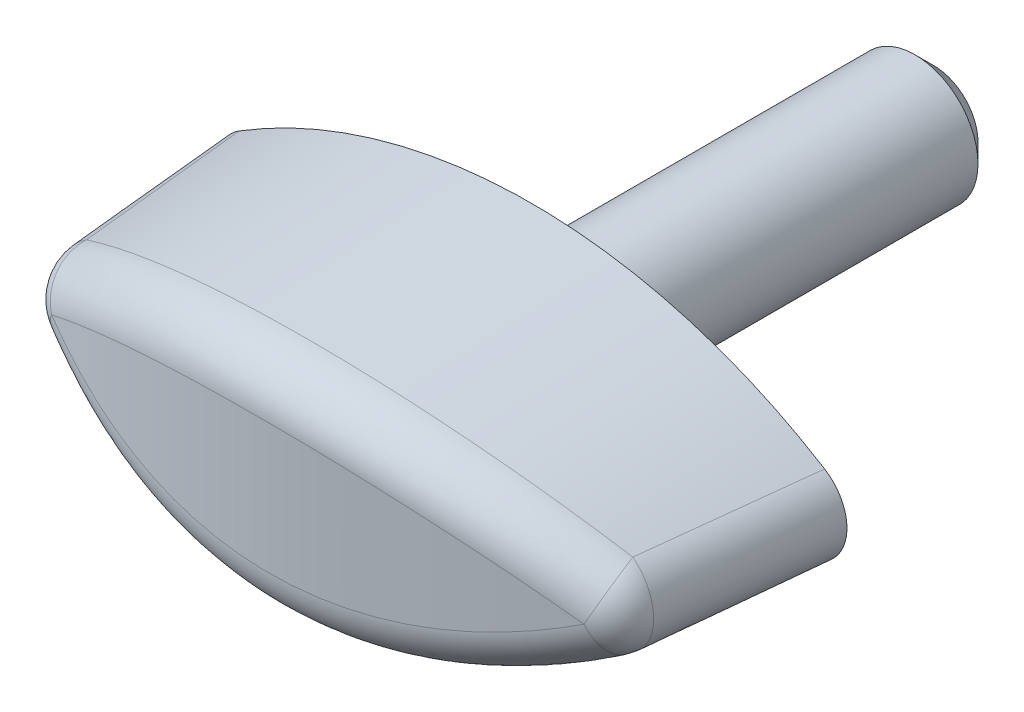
ISO-10303-21;
HEADER;
FILE_DESCRIPTION(('STEP AP214'),'2;1');
FILE_NAME('part.step','',(''),(''),'','','');
FILE_SCHEMA(('AUTOMOTIVE_DESIGN { 1 0 10303 214 1 1 1 1 }'));
ENDSEC;
DATA;
#1=APPLICATION_CONTEXT('core data for automotive mechanical design processes');
#2=APPLICATION_PROTOCOL_DEFINITION('international standard','automotive_design',2000,#1);
#3=PRODUCT_CONTEXT('',#1,'mechanical');
#4=PRODUCT('Part','Part','',(#3));
#5=PRODUCT_RELATED_PRODUCT_CATEGORY('part','',(#4));
#6=PRODUCT_DEFINITION_FORMATION('','',#4);
#7=PRODUCT_DEFINITION_CONTEXT('part definition',#1,'design');
#8=PRODUCT_DEFINITION('design','',#6,#7);
#9=PRODUCT_DEFINITION_SHAPE('','',#8);
#10=(LENGTH_UNIT() NAMED_UNIT(*) SI_UNIT(.MILLI.,.METRE.));
#11=(NAMED_UNIT(*) PLANE_ANGLE_UNIT() SI_UNIT($,.RADIAN.));
#12=(NAMED_UNIT(*) SI_UNIT($,.STERADIAN.) SOLID_ANGLE_UNIT());
#13=UNCERTAINTY_MEASURE_WITH_UNIT(LENGTH_MEASURE(1.E-05),#10,'distance_accuracy_value','');
#14=(GEOMETRIC_REPRESENTATION_CONTEXT(3) GLOBAL_UNCERTAINTY_ASSIGNED_CONTEXT((#13)) GLOBAL_UNIT_ASSIGNED_CONTEXT((#10,
#11,#12)) REPRESENTATION_CONTEXT('',''));
#15=CARTESIAN_POINT('',(0.,0.,0.));
#16=DIRECTION('',(0.,0.,1.));
#17=DIRECTION('',(1.,0.,0.));
#18=AXIS2_PLACEMENT_3D('',#15,#16,#17);
#19=CARTESIAN_POINT('',(-0.133482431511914,-27.3688144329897,0.4));
#20=DIRECTION('',(0.,0.,-1.));
#21=DIRECTION('',(1.,0.,0.));
#22=AXIS2_PLACEMENT_3D('',#19,#20,#21);
#23=CONICAL_SURFACE('',#22,35.2188144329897,0.05235987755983);
#24=CARTESIAN_POINT('',(-0.133482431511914,-27.3688144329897,0.4));
#25=DIRECTION('',(0.,0.,1.));
#26=DIRECTION('',(1.,0.,0.));
#27=AXIS2_PLACEMENT_3D('',#24,#25,#26);
#28=CIRCLE('',#27,35.2188144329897);
#29=CARTESIAN_POINT('',(18.455587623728,2.54458331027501,0.4));
#30=VERTEX_POINT('',#29);
#31=CARTESIAN_POINT('',(-18.7225524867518,2.54458331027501,0.4));
#32=VERTEX_POINT('',#31);
#33=EDGE_CURVE('E235',#30,#32,#28,.T.);
#34=ORIENTED_EDGE('',*,*,#33,.T.);
#35=CARTESIAN_POINT('',(-9.94764058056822,2.84937929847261,66.1700536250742));
#36=CARTESIAN_POINT('',(-11.9799614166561,2.17032947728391,66.5148628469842));
#37=CARTESIAN_POINT('',(-11.9799614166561,0.,66.5148628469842));
#38=CARTESIAN_POINT('',(-11.9799614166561,-2.1703294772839,66.5148628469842));
#39=CARTESIAN_POINT('',(-9.94764058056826,-2.84937929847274,66.1700536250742));
#40=CARTESIAN_POINT('',(-10.0634314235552,2.84614228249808,65.5462752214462));
#41=CARTESIAN_POINT('',(-12.0865456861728,2.1624595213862,65.8866121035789));
#42=CARTESIAN_POINT('',(-12.0866767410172,0.,65.8858334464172));
#43=CARTESIAN_POINT('',(-12.0865456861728,-2.16245952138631,65.8866121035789));
#44=CARTESIAN_POINT('',(-10.0634314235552,-2.84614228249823,65.5462752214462));
#45=CARTESIAN_POINT('',(-10.1773690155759,2.84291485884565,64.9222194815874));
#46=CARTESIAN_POINT('',(-12.1915627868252,2.15475428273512,65.2575420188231));
#47=CARTESIAN_POINT('',(-12.1916856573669,0.,65.2567934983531));
#48=CARTESIAN_POINT('',(-12.1915627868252,-2.15475428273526,65.2575420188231));
#49=CARTESIAN_POINT('',(-10.1773690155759,-2.84291485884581,64.9222194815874));
#50=CARTESIAN_POINT('',(-10.4018549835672,2.83647934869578,63.6736155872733));
#51=CARTESIAN_POINT('',(-12.3984693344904,2.13966577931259,63.9994335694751));
#52=CARTESIAN_POINT('',(-12.3985927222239,0.,63.9986847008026));
#53=CARTESIAN_POINT('',(-12.3984693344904,-2.13966577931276,63.9994335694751));
#54=CARTESIAN_POINT('',(-10.4018549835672,-2.83647934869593,63.6736155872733));
#55=CARTESIAN_POINT('',(-10.5124033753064,2.83327126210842,63.0490674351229));
#56=CARTESIAN_POINT('',(-12.5003766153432,2.13228099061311,63.3703319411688));
#57=CARTESIAN_POINT('',(-12.5004908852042,0.,63.3696158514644));
#58=CARTESIAN_POINT('',(-12.5003766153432,-2.13228099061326,63.3703319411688));
#59=CARTESIAN_POINT('',(-10.5124033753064,-2.83327126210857,63.0490674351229));
#60=CARTESIAN_POINT('',(-10.8394372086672,2.82367633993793,61.1747980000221));
#61=CARTESIAN_POINT('',(-12.8015122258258,2.1105902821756,61.4852332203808));
#62=CARTESIAN_POINT('',(-12.8019691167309,0.,61.4823746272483));
#63=CARTESIAN_POINT('',(-12.8015122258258,-2.11059028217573,61.4852332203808));
#64=CARTESIAN_POINT('',(-10.8394372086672,-2.82367633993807,61.1747980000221));
#65=CARTESIAN_POINT('',(-11.0513166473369,2.81731869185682,59.9244228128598));
#66=CARTESIAN_POINT('',(-12.9969375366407,2.09669040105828,60.2267788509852));
#67=CARTESIAN_POINT('',(-12.9973378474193,0.,60.2241384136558));
#68=CARTESIAN_POINT('',(-12.9969375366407,-2.09669040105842,60.2267788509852));
#69=CARTESIAN_POINT('',(-11.0513166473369,-2.81731869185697,59.9244228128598));
#70=CARTESIAN_POINT('',(-11.4647261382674,2.8046821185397,57.4223869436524));
#71=CARTESIAN_POINT('',(-13.3782702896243,2.06988168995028,57.7101943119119));
#72=CARTESIAN_POINT('',(-13.3786682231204,0.,57.7075667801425));
#73=CARTESIAN_POINT('',(-13.3782702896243,-2.06988168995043,57.7101943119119));
#74=CARTESIAN_POINT('',(-11.4647261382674,-2.80468211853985,57.4223869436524));
#75=CARTESIAN_POINT('',(-11.6662569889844,2.79840318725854,56.1707263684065));
#76=CARTESIAN_POINT('',(-13.5642765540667,2.05696454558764,56.4516773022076));
#77=CARTESIAN_POINT('',(-13.5646305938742,0.,56.4492313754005));
#78=CARTESIAN_POINT('',(-13.5642765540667,-2.0569645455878,56.4516773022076));
#79=CARTESIAN_POINT('',(-11.6662569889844,-2.79840318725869,56.1707263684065));
#80=CARTESIAN_POINT('',(-12.0604561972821,2.78592331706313,53.6662651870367));
#81=CARTESIAN_POINT('',(-13.9281862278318,2.03197951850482,53.9347762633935));
#82=CARTESIAN_POINT('',(-13.9285373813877,0.,53.9323448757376));
#83=CARTESIAN_POINT('',(-13.9281862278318,-2.03197951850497,53.9347762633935));
#84=CARTESIAN_POINT('',(-12.0604561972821,-2.78592331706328,53.6662651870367));
#85=CARTESIAN_POINT('',(-12.2531244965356,2.77972237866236,52.4134645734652));
#86=CARTESIAN_POINT('',(-14.1061688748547,2.01990506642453,52.6760596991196));
#87=CARTESIAN_POINT('',(-14.1064817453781,0.,52.6737937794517));
#88=CARTESIAN_POINT('',(-14.1061688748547,-2.01990506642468,52.6760596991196));
#89=CARTESIAN_POINT('',(-12.2531244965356,-2.77972237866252,52.4134645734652));
#90=CARTESIAN_POINT('',(-12.8195712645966,2.76123825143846,48.6541414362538));
#91=CARTESIAN_POINT('',(-14.6286414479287,1.98485174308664,48.9073744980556));
#92=CARTESIAN_POINT('',(-14.6299004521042,0.,48.8983113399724));
#93=CARTESIAN_POINT('',(-14.6286414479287,-1.98485174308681,48.9073744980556));
#94=CARTESIAN_POINT('',(-12.8195712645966,-2.76123825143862,48.6541414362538));
#95=CARTESIAN_POINT('',(-13.1818709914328,2.74907129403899,46.1462109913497));
#96=CARTESIAN_POINT('',(-14.963998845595,1.96287987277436,46.389071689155));
#97=CARTESIAN_POINT('',(-14.9650336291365,0.,46.3810615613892));
#98=CARTESIAN_POINT('',(-14.963998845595,-1.96287987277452,46.389071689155));
#99=CARTESIAN_POINT('',(-13.1818709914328,-2.74907129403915,46.1462109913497));
#100=CARTESIAN_POINT('',(-13.8826914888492,2.72504071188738,41.1276098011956));
#101=CARTESIAN_POINT('',(-15.6129960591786,1.92123528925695,41.353678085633));
#102=CARTESIAN_POINT('',(-15.6140160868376,0.,41.3457454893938));
#103=CARTESIAN_POINT('',(-15.6129960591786,-1.9212352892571,41.353678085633));
#104=CARTESIAN_POINT('',(-13.8826914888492,-2.72504071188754,41.1276098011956));
#105=CARTESIAN_POINT('',(-14.2212117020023,2.71317709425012,38.6169389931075));
#106=CARTESIAN_POINT('',(-15.9270018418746,1.9015334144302,38.8347968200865));
#107=CARTESIAN_POINT('',(-15.9278648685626,0.,38.8276791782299));
#108=CARTESIAN_POINT('',(-15.9270018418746,-1.90153341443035,38.8347968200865));
#109=CARTESIAN_POINT('',(-14.2212117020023,-2.71317709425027,38.6169389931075));
#110=CARTESIAN_POINT('',(-14.8789448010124,2.68974887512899,33.5943492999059));
#111=CARTESIAN_POINT('',(-16.5375019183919,1.86398835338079,33.7987360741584));
#112=CARTESIAN_POINT('',(-16.5383589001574,0.,33.7916652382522));
#113=CARTESIAN_POINT('',(-16.5375019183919,-1.86398835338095,33.7987360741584));
#114=CARTESIAN_POINT('',(-14.8789448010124,-2.68974887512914,33.5943492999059));
#115=CARTESIAN_POINT('',(-15.198163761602,2.67818418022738,31.0824310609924));
#116=CARTESIAN_POINT('',(-16.8342730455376,1.84612351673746,31.2801176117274));
#117=CARTESIAN_POINT('',(-16.8350095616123,0.,31.2737178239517));
#118=CARTESIAN_POINT('',(-16.8342730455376,-1.84612351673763,31.2801176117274));
#119=CARTESIAN_POINT('',(-15.198163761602,-2.67818418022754,31.0824310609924));
#120=CARTESIAN_POINT('',(-15.8207459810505,2.6553411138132,26.0570201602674));
#121=CARTESIAN_POINT('',(-17.4135109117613,1.81192131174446,26.2436110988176));
#122=CARTESIAN_POINT('',(-17.4142419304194,0.,26.2372505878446));
#123=CARTESIAN_POINT('',(-17.4135109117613,-1.81192131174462,26.2436110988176));
#124=CARTESIAN_POINT('',(-15.8207459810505,-2.65534111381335,26.0570201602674));
#125=CARTESIAN_POINT('',(-16.1241093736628,2.64406273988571,23.5435275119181));
#126=CARTESIAN_POINT('',(-17.6961864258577,1.79556816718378,23.7245322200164));
#127=CARTESIAN_POINT('',(-17.6968237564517,0.,23.7187307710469));
#128=CARTESIAN_POINT('',(-17.6961864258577,-1.79556816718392,23.7245322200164));
#129=CARTESIAN_POINT('',(-16.1241093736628,-2.64406273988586,23.5435275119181));
#130=CARTESIAN_POINT('',(-16.7174960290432,2.62178242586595,18.5151154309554));
#131=CARTESIAN_POINT('',(-18.2495558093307,1.76414591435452,18.6868014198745));
#132=CARTESIAN_POINT('',(-18.2501901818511,0.,18.6810256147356));
#133=CARTESIAN_POINT('',(-18.2495558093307,-1.76414591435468,18.6868014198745));
#134=CARTESIAN_POINT('',(-16.7174960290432,-2.62178242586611,18.5151154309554));
#135=CARTESIAN_POINT('',(-17.0075185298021,2.61078050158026,16.0001959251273));
#136=CARTESIAN_POINT('',(-18.5204137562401,1.74906476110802,16.1671467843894));
#137=CARTESIAN_POINT('',(-18.5209741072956,0.,16.161840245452));
#138=CARTESIAN_POINT('',(-18.5204137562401,-1.74906476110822,16.1671467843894));
#139=CARTESIAN_POINT('',(-17.007518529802,-2.61078050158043,16.0001959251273));
#140=CARTESIAN_POINT('',(-17.5761162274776,2.58904463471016,10.969297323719));
#141=CARTESIAN_POINT('',(-19.0518906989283,1.72000174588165,11.1282747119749));
#142=CARTESIAN_POINT('',(-19.0524458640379,0.,11.1230051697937));
#143=CARTESIAN_POINT('',(-19.0518906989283,-1.72000174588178,11.1282747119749));
#144=CARTESIAN_POINT('',(-17.5761162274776,-2.58904463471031,10.969297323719));
#145=CARTESIAN_POINT('',(-17.8546913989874,2.57831069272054,8.45331822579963));
#146=CARTESIAN_POINT('',(-19.3126426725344,1.70601035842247,8.60820031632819));
#147=CARTESIAN_POINT('',(-19.3131336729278,0.,8.60335546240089));
#148=CARTESIAN_POINT('',(-19.3126426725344,-1.7060103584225,8.60820031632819));
#149=CARTESIAN_POINT('',(-17.8546913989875,-2.57831069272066,8.45331822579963));
#150=CARTESIAN_POINT('',(-18.6754152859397,2.54650453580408,0.905774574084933));
#151=CARTESIAN_POINT('',(-20.0800124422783,1.66554621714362,1.06490118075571));
#152=CARTESIAN_POINT('',(-20.0819891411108,0.,1.0455066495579));
#153=CARTESIAN_POINT('',(-20.0800124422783,-1.66554621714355,1.06490118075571));
#154=CARTESIAN_POINT('',(-18.6754152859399,-2.54650453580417,0.905774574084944));
#155=CARTESIAN_POINT('',(-19.2027619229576,2.52582042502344,-4.12710669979));
#156=CARTESIAN_POINT('',(-20.5755333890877,1.64037213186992,-3.97658913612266));
#157=CARTESIAN_POINT('',(-20.5771350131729,0.,-3.9933054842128));
#158=CARTESIAN_POINT('',(-20.5755333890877,-1.64037213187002,-3.97658913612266));
#159=CARTESIAN_POINT('',(-19.2027619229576,-2.52582042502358,-4.12710669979));
#160=CARTESIAN_POINT('',(-20.2268944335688,2.4854191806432,-14.1952793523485));
#161=CARTESIAN_POINT('',(-21.5390704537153,1.59297490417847,-14.0555607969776));
#162=CARTESIAN_POINT('',(-21.5406472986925,-1.16511262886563E-13,-14.0720924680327));
#163=CARTESIAN_POINT('',(-21.5390704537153,-1.5929749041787,-14.0555607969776));
#164=CARTESIAN_POINT('',(-20.2268944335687,-2.48541918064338,-14.1952793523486));
#165=CARTESIAN_POINT('',(-20.7236810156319,2.46570202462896,-19.230570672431));
#166=CARTESIAN_POINT('',(-22.0076989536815,1.57071112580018,-19.0975815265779));
#167=CARTESIAN_POINT('',(-22.0090143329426,0.,-19.1120672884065));
#168=CARTESIAN_POINT('',(-22.0076989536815,-1.57071112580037,-19.0975815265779));
#169=CARTESIAN_POINT('',(-20.7236810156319,-2.46570202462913,-19.230570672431));
#170=CARTESIAN_POINT('',(-21.6928739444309,2.42716450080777,-29.3045674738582));
#171=CARTESIAN_POINT('',(-22.9231486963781,1.52853719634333,-29.1801362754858));
#172=CARTESIAN_POINT('',(-22.9244569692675,0.,-29.1945468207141));
#173=CARTESIAN_POINT('',(-22.9231486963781,-1.52853719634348,-29.1801362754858));
#174=CARTESIAN_POINT('',(-21.6928739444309,-2.42716450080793,-29.3045674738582));
#175=CARTESIAN_POINT('',(-22.1652730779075,2.40834439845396,-34.3432735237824));
#176=CARTESIAN_POINT('',(-23.3704165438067,1.50859917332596,-34.2242978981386));
#177=CARTESIAN_POINT('',(-23.3715262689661,0.,-34.2370518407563));
#178=CARTESIAN_POINT('',(-23.3704165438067,-1.50859917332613,-34.2242978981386));
#179=CARTESIAN_POINT('',(-22.1652730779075,-2.40834439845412,-34.3432735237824));
#180=CARTESIAN_POINT('',(-22.858760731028,2.38074702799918,-41.902509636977));
#181=CARTESIAN_POINT('',(-24.0286834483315,1.4801068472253,-41.7983357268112));
#182=CARTESIAN_POINT('',(-24.0289576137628,0.,-41.801497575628));
#183=CARTESIAN_POINT('',(-24.0286834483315,-1.48010684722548,-41.7983357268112));
#184=CARTESIAN_POINT('',(-22.858760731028,-2.38074702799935,-41.902509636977));
#185=CARTESIAN_POINT('',(-23.0874066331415,2.37165329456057,-44.42247237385));
#186=CARTESIAN_POINT('',(-24.2456523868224,1.47085913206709,-44.3201209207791));
#187=CARTESIAN_POINT('',(-24.2459077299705,0.,-44.3231153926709));
#188=CARTESIAN_POINT('',(-24.2456523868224,-1.47085913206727,-44.3201209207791));
#189=CARTESIAN_POINT('',(-23.0874066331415,-2.37165329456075,-44.42247237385));
#190=CARTESIAN_POINT('',(-23.5400779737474,2.35366995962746,-49.462737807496));
#191=CARTESIAN_POINT('',(-24.6755293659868,1.45280372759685,-49.3635662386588));
#192=CARTESIAN_POINT('',(-24.6757834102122,0.,-49.3665480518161));
#193=CARTESIAN_POINT('',(-24.6755293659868,-1.45280372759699,-49.3635662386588));
#194=CARTESIAN_POINT('',(-23.5400779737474,-2.35366995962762,-49.462737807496));
#195=CARTESIAN_POINT('',(-23.7641034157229,2.34478035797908,-51.9830405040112));
#196=CARTESIAN_POINT('',(-24.8884756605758,1.4439937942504,-51.8855627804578));
#197=CARTESIAN_POINT('',(-24.8887089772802,0.,-51.8883628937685));
#198=CARTESIAN_POINT('',(-24.8884756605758,-1.44399379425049,-51.8855627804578));
#199=CARTESIAN_POINT('',(-23.7641034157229,-2.34478035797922,-51.9830405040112));
#200=CARTESIAN_POINT('',(-23.9860278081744,2.33598938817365,-54.5034959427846));
#201=CARTESIAN_POINT('',(-25.0998062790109,1.43537470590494,-54.4102690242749));
#202=CARTESIAN_POINT('',(-25.0998062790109,0.,-54.4102690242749));
#203=CARTESIAN_POINT('',(-25.0998062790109,-1.43537470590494,-54.4102690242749));
#204=CARTESIAN_POINT('',(-23.9860278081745,-2.33598938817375,-54.5034959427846));
#205=(BOUNDED_SURFACE() B_SPLINE_SURFACE(3,2,((#35,#36,#37,#38,#39),(#40,#41,#42,#43,#44),(#45,
#46,#47,#48,#49),(#50,#51,#52,#53,#54),(#55,#56,#57,#58,#59),(#60,#61,#62,#63,#64),(#65,#66,#67,
#68,#69),(#70,#71,#72,#73,#74),(#75,#76,#77,#78,#79),(#80,#81,#82,#83,#84),(#85,#86,#87,#88,
#89),(#90,#91,#92,#93,#94),(#95,#96,#97,#98,#99),(#100,#101,#102,#103,#104),(#105,#106,#107,
#108,#109),(#110,#111,#112,#113,#114),(#115,#116,#117,#118,#119),(#120,#121,#122,#123,#124),
(#125,#126,#127,#128,#129),(#130,#131,#132,#133,#134),(#135,#136,#137,#138,#139),(#140,#141,
#142,#143,#144),(#145,#146,#147,#148,#149),(#150,#151,#152,#153,#154),(#155,#156,#157,#158,
#159),(#160,#161,#162,#163,#164),(#165,#166,#167,#168,#169),(#170,#171,#172,#173,#174),(#175,
#176,#177,#178,#179),(#180,#181,#182,#183,#184),(#185,#186,#187,#188,#189),(#190,#191,#192,#193,
#194),(#195,#196,#197,#198,#199),(#200,#201,#202,#203,#204)),.UNSPECIFIED.,.F.,.F.,
.F.) B_SPLINE_SURFACE_WITH_KNOTS((4,2,2,2,2,2,2,2,2,2,2,2,2,2,2,2,4),(3,2,3),(0.,
1.89806852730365,3.79612822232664,7.59215961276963,11.3878976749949,15.1836607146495,
22.7737107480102,30.3639386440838,37.9517650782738,45.5395274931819,53.1277227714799,
60.715934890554,75.8871979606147,91.0581091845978,106.233482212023,113.821296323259,
121.409104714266),(0.,0.5,1.),
.UNSPECIFIED.) GEOMETRIC_REPRESENTATION_ITEM() RATIONAL_B_SPLINE_SURFACE(((1.,0.810209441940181,
1.,0.810209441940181,1.),(1.,0.811220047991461,1.,0.811220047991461,1.),(1.,0.812208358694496,
1.,0.812208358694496,1.),(1.,0.814144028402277,1.,0.814144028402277,1.),(1.,0.815091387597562,
1.,0.815091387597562,1.),(1.,0.817877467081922,1.,0.817877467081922,1.),(1.,0.819660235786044,
1.,0.819660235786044,1.),(1.,0.823099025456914,1.,0.823099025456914,1.),(1.,0.824755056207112,
1.,0.824755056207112,1.),(1.,0.827957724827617,1.,0.827957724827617,1.),(1.,0.829504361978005,
1.,0.829504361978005,1.),(1.,0.834000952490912,1.,0.834000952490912,1.),(1.,0.836808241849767,
1.,0.836808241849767,1.),(1.,0.842123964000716,1.,0.842123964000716,1.),(1.,0.844632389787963,
1.,0.844632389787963,1.),(1.,0.849405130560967,1.,0.849405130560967,1.),(1.,0.85166952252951,1.,
0.85166952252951,1.),(1.,0.855995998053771,1.,0.855995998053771,1.),(1.,0.858058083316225,1.,
0.858058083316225,1.),(1.,0.86201098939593,1.,0.86201098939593,1.),(1.,0.86390180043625,1.,
0.86390180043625,1.),(1.,0.867535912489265,1.,0.867535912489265,1.),(1.,0.869279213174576,1.,
0.869279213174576,1.),(1.,0.874316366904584,1.,0.874316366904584,1.),(1.,0.877418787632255,1.,
0.877418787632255,1.),(1.,0.8832267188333,1.,0.8832267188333,1.),(1.,0.885932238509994,1.,
0.885932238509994,1.),(1.,0.89102494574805,1.,0.89102494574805,1.),(1.,0.893412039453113,1.,
0.893412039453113,1.),(1.,0.896796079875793,1.,0.896796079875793,1.),(1.,0.897891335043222,1.,
0.897891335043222,1.),(1.,0.900021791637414,1.,0.900021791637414,1.),(1.,0.901056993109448,1.,
0.901056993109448,1.),(1.,0.902064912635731,1.,0.902064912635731,1.))) REPRESENTATION_ITEM('') SURFACE());
#206=CARTESIAN_POINT('',(-23.9860278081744,2.33598938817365,-54.5034959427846));
#207=CARTESIAN_POINT('',(-23.7641034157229,2.34478035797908,-51.9830405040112));
#208=CARTESIAN_POINT('',(-23.5400779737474,2.35366995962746,-49.462737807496));
#209=CARTESIAN_POINT('',(-23.0874066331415,2.37165329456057,-44.42247237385));
#210=CARTESIAN_POINT('',(-22.858760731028,2.38074702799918,-41.902509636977));
#211=CARTESIAN_POINT('',(-22.1652730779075,2.40834439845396,-34.3432735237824));
#212=CARTESIAN_POINT('',(-21.6928739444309,2.42716450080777,-29.3045674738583));
#213=CARTESIAN_POINT('',(-20.7236810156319,2.46570202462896,-19.230570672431));
#214=CARTESIAN_POINT('',(-20.2268944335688,2.4854191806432,-14.1952793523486));
#215=CARTESIAN_POINT('',(-19.2027619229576,2.52582042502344,-4.12710669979));
#216=CARTESIAN_POINT('',(-18.6754152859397,2.54650453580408,0.90577457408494));
#217=CARTESIAN_POINT('',(-17.8546913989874,2.57831069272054,8.45331822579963));
#218=CARTESIAN_POINT('',(-17.5761162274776,2.58904463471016,10.969297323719));
#219=CARTESIAN_POINT('',(-17.0075185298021,2.61078050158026,16.0001959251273));
#220=CARTESIAN_POINT('',(-16.7174960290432,2.62178242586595,18.5151154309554));
#221=CARTESIAN_POINT('',(-16.1241093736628,2.64406273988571,23.5435275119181));
#222=CARTESIAN_POINT('',(-15.8207459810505,2.6553411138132,26.0570201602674));
#223=CARTESIAN_POINT('',(-15.198163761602,2.67818418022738,31.0824310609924));
#224=CARTESIAN_POINT('',(-14.8789448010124,2.68974887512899,33.5943492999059));
#225=CARTESIAN_POINT('',(-14.2212117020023,2.71317709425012,38.6169389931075));
#226=CARTESIAN_POINT('',(-13.8826914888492,2.72504071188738,41.1276098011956));
#227=CARTESIAN_POINT('',(-13.1818709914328,2.74907129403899,46.1462109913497));
#228=CARTESIAN_POINT('',(-12.8195712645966,2.76123825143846,48.6541414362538));
#229=CARTESIAN_POINT('',(-12.2531244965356,2.77972237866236,52.4134645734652));
#230=CARTESIAN_POINT('',(-12.0604561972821,2.78592331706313,53.6662651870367));
#231=CARTESIAN_POINT('',(-11.6662569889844,2.79840318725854,56.1707263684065));
#232=CARTESIAN_POINT('',(-11.4647261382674,2.8046821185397,57.4223869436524));
#233=CARTESIAN_POINT('',(-11.0513166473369,2.81731869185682,59.9244228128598));
#234=CARTESIAN_POINT('',(-10.8394372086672,2.82367633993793,61.1747980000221));
#235=CARTESIAN_POINT('',(-10.5124033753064,2.83327126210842,63.0490674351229));
#236=CARTESIAN_POINT('',(-10.4018549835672,2.83647934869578,63.6736155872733));
#237=CARTESIAN_POINT('',(-10.1773690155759,2.84291485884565,64.9222194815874));
#238=CARTESIAN_POINT('',(-10.0634314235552,2.84614228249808,65.5462752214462));
#239=CARTESIAN_POINT('',(-9.94764058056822,2.84937929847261,66.1700536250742));
#240=B_SPLINE_CURVE_WITH_KNOTS('',3,(#206,#207,#208,#209,#210,#211,#212,#213,#214,#215,#216,
#217,#218,#219,#220,#221,#222,#223,#224,#225,#226,#227,#228,#229,#230,#231,#232,#233,#234,#235,
#236,#237,#238,#239),.UNSPECIFIED.,.F.,.F.,(4,2,2,2,2,2,2,2,2,2,2,2,2,2,2,2,4),(0.,
7.58780839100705,15.1756225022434,30.3509955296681,45.5219067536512,60.6931698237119,
68.281381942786,75.869577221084,83.4573396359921,91.0451660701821,98.6353939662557,
106.225443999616,110.021207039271,113.816945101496,117.612976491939,119.511036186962,
121.409104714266),.UNSPECIFIED.);
#241=CARTESIAN_POINT('',(-17.5390517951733,2.5904405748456,11.2843807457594));
#242=VERTEX_POINT('',#241);
#243=EDGE_CURVE('E185',#32,#242,#240,.T.);
#244=ORIENTED_EDGE('',*,*,#243,.T.);
#245=CARTESIAN_POINT('',(-25.9116063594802,-6.5678676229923,9.45201347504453));
#246=CARTESIAN_POINT('',(-26.9623977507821,-5.22396085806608,8.77235175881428));
#247=CARTESIAN_POINT('',(-26.5522012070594,-4.61264985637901,7.09002431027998));
#248=CARTESIAN_POINT('',(-25.5819169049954,-6.22525334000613,9.66526230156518));
#249=CARTESIAN_POINT('',(-26.6372434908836,-4.84810499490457,8.99498365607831));
#250=CARTESIAN_POINT('',(-26.2149522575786,-4.23718862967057,7.28986126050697));
#251=CARTESIAN_POINT('',(-25.2442057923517,-5.8891721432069,9.8779192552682));
#252=CARTESIAN_POINT('',(-26.3045832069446,-4.4797963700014,9.21680138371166));
#253=CARTESIAN_POINT('',(-25.8694494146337,-3.86884377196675,7.48914356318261));
#254=CARTESIAN_POINT('',(-24.5528591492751,-5.23032017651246,10.3008712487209));
#255=CARTESIAN_POINT('',(-25.6221477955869,-3.75580524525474,9.65919199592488));
#256=CARTESIAN_POINT('',(-25.1620506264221,-3.14666241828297,7.88549480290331));
#257=CARTESIAN_POINT('',(-24.1992229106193,-4.90754999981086,10.5111661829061));
#258=CARTESIAN_POINT('',(-25.2722052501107,-3.40016897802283,9.87978368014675));
#259=CARTESIAN_POINT('',(-24.800153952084,-2.79282656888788,8.08256364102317));
#260=CARTESIAN_POINT('',(-23.1139686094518,-3.95902178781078,11.13710505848));
#261=CARTESIAN_POINT('',(-24.1918677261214,-2.3481514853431,10.5407319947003));
#262=CARTESIAN_POINT('',(-23.6893939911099,-1.75289230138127,8.6691352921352));
#263=CARTESIAN_POINT('',(-22.3586268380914,-3.35369283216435,11.5473966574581));
#264=CARTESIAN_POINT('',(-23.4385749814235,-1.67552627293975,10.9749701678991));
#265=CARTESIAN_POINT('',(-22.9160968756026,-1.08907596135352,9.05362238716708));
#266=CARTESIAN_POINT('',(-20.7818551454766,-2.19765537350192,12.346700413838));
#267=CARTESIAN_POINT('',(-21.8579618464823,-0.382152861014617,11.82673286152));
#268=CARTESIAN_POINT('',(-21.3014107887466,0.178913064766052,9.80265546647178));
#269=CARTESIAN_POINT('',(-19.9600203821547,-1.64733547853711,12.7355535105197));
#270=CARTESIAN_POINT('',(-21.029239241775,0.237229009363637,12.2437476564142));
#271=CARTESIAN_POINT('',(-20.4596044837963,0.782661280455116,10.1670523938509));
#272=CARTESIAN_POINT('',(-18.2575571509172,-0.610848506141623,13.4796245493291));
#273=CARTESIAN_POINT('',(-19.302109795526,1.41287325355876,13.0479460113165));
#274=CARTESIAN_POINT('',(-18.715340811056,1.91998638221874,10.8643265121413));
#275=CARTESIAN_POINT('',(-17.3769597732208,-0.124647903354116,13.834860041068));
#276=CARTESIAN_POINT('',(-18.4031396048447,1.96785628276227,13.4344551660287));
#277=CARTESIAN_POINT('',(-17.8129155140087,2.45359993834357,11.1972201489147));
#278=CARTESIAN_POINT('',(-15.7351261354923,0.691442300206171,14.4386374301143));
#279=CARTESIAN_POINT('',(-16.7179486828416,2.90601325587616,14.0960791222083));
#280=CARTESIAN_POINT('',(-16.1300201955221,3.34941894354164,11.7630241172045));
#281=CARTESIAN_POINT('',(-14.9834257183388,1.03342158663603,14.6945703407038));
#282=CARTESIAN_POINT('',(-15.9413192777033,3.3018014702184,14.3784810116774));
#283=CARTESIAN_POINT('',(-15.3593923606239,3.72486502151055,12.002860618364));
#284=CARTESIAN_POINT('',(-13.4470034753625,1.66864621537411,15.1740241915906));
#285=CARTESIAN_POINT('',(-14.3447208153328,4.04212002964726,14.9112368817));
#286=CARTESIAN_POINT('',(-13.7840433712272,4.42233580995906,12.4521601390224));
#287=CARTESIAN_POINT('',(-12.6622879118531,1.96190074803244,15.3975512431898));
#288=CARTESIAN_POINT('',(-13.5251739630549,4.38565861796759,15.1609311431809));
#289=CARTESIAN_POINT('',(-12.9793286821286,4.74437059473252,12.6616288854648));
#290=CARTESIAN_POINT('',(-11.0663718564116,2.49543766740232,15.8071244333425));
#291=CARTESIAN_POINT('',(-11.8487521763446,5.0150093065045,15.6216067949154));
#292=CARTESIAN_POINT('',(-11.3425277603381,5.33032755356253,13.0454427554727));
#293=CARTESIAN_POINT('',(-10.255274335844,2.73590291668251,15.993299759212));
#294=CARTESIAN_POINT('',(-10.9928496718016,5.29998469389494,15.8319990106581));
#295=CARTESIAN_POINT('',(-10.5105478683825,5.59445033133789,13.2199089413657));
#296=CARTESIAN_POINT('',(-8.6088043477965,3.16197518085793,16.3252089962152));
#297=CARTESIAN_POINT('',(-9.24591509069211,5.80822566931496,16.2094862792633));
#298=CARTESIAN_POINT('',(-8.82151313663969,6.06247820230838,13.5309433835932));
#299=CARTESIAN_POINT('',(-7.77343736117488,3.34759447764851,16.4709519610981));
#300=CARTESIAN_POINT('',(-8.35623326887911,6.03049926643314,16.375865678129));
#301=CARTESIAN_POINT('',(-7.96446395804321,6.26639677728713,13.6675201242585));
#302=CARTESIAN_POINT('',(-6.30456128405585,3.62036059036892,16.6864405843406));
#303=CARTESIAN_POINT('',(-6.78569450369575,6.35873278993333,16.6229913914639));
#304=CARTESIAN_POINT('',(-6.45734742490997,6.56607248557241,13.8694560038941));
#305=CARTESIAN_POINT('',(-5.67521841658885,3.7205637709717,16.7660933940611));
#306=CARTESIAN_POINT('',(-6.11075264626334,6.47970396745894,16.7146060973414));
#307=CARTESIAN_POINT('',(-5.81158450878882,6.67616820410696,13.9440992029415));
#308=CARTESIAN_POINT('',(-4.40886396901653,3.88868776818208,16.9005531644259));
#309=CARTESIAN_POINT('',(-4.74888712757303,6.68337557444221,16.8697106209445));
#310=CARTESIAN_POINT('',(-4.51213654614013,6.86089822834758,14.0701023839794));
#311=CARTESIAN_POINT('',(-3.77185121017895,3.95660355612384,16.9553562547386));
#312=CARTESIAN_POINT('',(-4.06281663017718,6.76579746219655,16.9329921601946));
#313=CARTESIAN_POINT('',(-3.85845028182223,6.93552701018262,14.1214587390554));
#314=CARTESIAN_POINT('',(-2.49262969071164,4.0595240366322,17.0393945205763));
#315=CARTESIAN_POINT('',(-2.6822628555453,6.89108237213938,17.0301954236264));
#316=CARTESIAN_POINT('',(-2.54571236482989,7.04862641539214,14.2002115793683));
#317=CARTESIAN_POINT('',(-1.85041735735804,4.09450374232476,17.0686102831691));
#318=CARTESIAN_POINT('',(-1.98872288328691,6.93373781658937,17.063960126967));
#319=CARTESIAN_POINT('',(-1.88665702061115,7.08706958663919,14.2275898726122));
#320=CARTESIAN_POINT('',(-0.564408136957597,4.13112920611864,17.1010243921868));
#321=CARTESIAN_POINT('',(-0.598226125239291,6.97862079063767,17.1013373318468));
#322=CARTESIAN_POINT('',(-0.566907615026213,7.12733004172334,14.2579653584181));
#323=CARTESIAN_POINT('',(0.0793884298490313,4.13278122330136,17.1042276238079));
#324=CARTESIAN_POINT('',(0.0977321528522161,6.98078942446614,17.1049030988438));
#325=CARTESIAN_POINT('',(0.0937861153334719,7.12915420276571,14.2609671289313));
#326=CARTESIAN_POINT('',(1.57701571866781,4.09777629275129,17.0813510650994));
#327=CARTESIAN_POINT('',(1.71713036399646,6.93858223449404,17.0779434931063));
#328=CARTESIAN_POINT('',(1.63071048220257,7.09071283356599,14.2395293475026));
#329=CARTESIAN_POINT('',(2.43040750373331,4.048363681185,17.0453117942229));
#330=CARTESIAN_POINT('',(2.63838773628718,6.87879894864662,17.035916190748));
#331=CARTESIAN_POINT('',(2.50648743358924,7.03643179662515,14.2057566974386));
#332=CARTESIAN_POINT('',(4.12803164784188,3.89140741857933,16.9281394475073));
#333=CARTESIAN_POINT('',(4.46966477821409,6.68874417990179,16.8996130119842));
#334=CARTESIAN_POINT('',(4.24857850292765,6.86400449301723,14.0959536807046));
#335=CARTESIAN_POINT('',(4.97226212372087,3.78385203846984,16.846997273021));
#336=CARTESIAN_POINT('',(5.37748567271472,6.5589210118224,16.8056638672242));
#337=CARTESIAN_POINT('',(5.11489067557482,6.74584534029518,14.0199147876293));
#338=CARTESIAN_POINT('',(6.64527404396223,3.51223605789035,16.6415410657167));
#339=CARTESIAN_POINT('',(7.17264885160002,6.23160893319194,16.5683895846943));
#340=CARTESIAN_POINT('',(6.83155366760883,6.44746416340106,13.8273803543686));
#341=CARTESIAN_POINT('',(7.47404940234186,3.34815367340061,16.5172103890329));
#342=CARTESIAN_POINT('',(8.05810540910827,6.03483393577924,16.4255836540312));
#343=CARTESIAN_POINT('',(7.68189820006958,6.26721821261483,13.7108692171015));
#344=CARTESIAN_POINT('',(9.10997409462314,2.96588856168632,16.228232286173));
#345=CARTESIAN_POINT('',(9.80010659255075,5.57782829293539,16.0948656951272));
#346=CARTESIAN_POINT('',(9.36024997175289,5.84732885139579,13.440065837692));
#347=CARTESIAN_POINT('',(9.91712421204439,2.74770779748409,16.0635863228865));
#348=CARTESIAN_POINT('',(10.6551942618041,5.31851951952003,15.9076146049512));
#349=CARTESIAN_POINT('',(10.1882580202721,5.60768759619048,13.2857749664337));
#350=CARTESIAN_POINT('',(11.5001483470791,2.26158364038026,15.698605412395));
#351=CARTESIAN_POINT('',(12.325250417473,4.74312513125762,15.4943867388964));
#352=CARTESIAN_POINT('',(11.8120079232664,5.07380137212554,12.9437488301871));
#353=CARTESIAN_POINT('',(12.2761816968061,1.99394845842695,15.498491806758));
#354=CARTESIAN_POINT('',(13.1393982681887,4.42838600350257,15.2693460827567));
#355=CARTESIAN_POINT('',(12.6079143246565,4.77989460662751,12.7562209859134));
#356=CARTESIAN_POINT('',(13.7982069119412,1.41110283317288,15.0658337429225));
#357=CARTESIAN_POINT('',(14.7286390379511,3.74621355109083,14.785275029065));
#358=CARTESIAN_POINT('',(14.1687093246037,4.13991192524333,12.3507741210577));
#359=CARTESIAN_POINT('',(14.5441984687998,1.09589190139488,14.8332889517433));
#360=CARTESIAN_POINT('',(15.5031761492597,3.37973795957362,14.5268890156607));
#361=CARTESIAN_POINT('',(14.9335976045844,3.79383547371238,12.1328547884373));
#362=CARTESIAN_POINT('',(16.0041198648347,0.420489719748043,14.3396389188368));
#363=CARTESIAN_POINT('',(17.011391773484,2.59848218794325,13.9813573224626));
#364=CARTESIAN_POINT('',(16.4302731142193,3.05239823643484,11.6702519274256));
#365=CARTESIAN_POINT('',(16.7180038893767,0.0602368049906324,14.0784945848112));
#366=CARTESIAN_POINT('',(17.744838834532,2.1845075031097,13.6947250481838));
#367=CARTESIAN_POINT('',(17.1620130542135,2.65696988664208,11.4255317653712));
#368=CARTESIAN_POINT('',(18.1103887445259,-0.702021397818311,13.5322812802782));
#369=CARTESIAN_POINT('',(19.1681779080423,1.31310015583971,13.0985006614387));
#370=CARTESIAN_POINT('',(18.5889836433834,1.82040931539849,10.9136714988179));
#371=CARTESIAN_POINT('',(18.7888850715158,-1.10403198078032,13.2472092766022));
#372=CARTESIAN_POINT('',(19.858181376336,0.856413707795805,12.7893404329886));
#373=CARTESIAN_POINT('',(19.2842096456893,1.37927129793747,10.6465285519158));
#374=CARTESIAN_POINT('',(20.180050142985,-1.99270985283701,12.6257896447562));
#375=CARTESIAN_POINT('',(21.2651061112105,-0.147392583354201,12.1194752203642));
#376=CARTESIAN_POINT('',(20.7094147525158,0.40425646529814,10.0641919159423));
#377=CARTESIAN_POINT('',(20.8884918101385,-2.48383094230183,12.2872296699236));
#378=CARTESIAN_POINT('',(21.9783423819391,-0.698893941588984,11.7567128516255));
#379=CARTESIAN_POINT('',(21.4350342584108,-0.134490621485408,9.74692502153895));
#380=CARTESIAN_POINT('',(22.2581097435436,-3.51104785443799,11.5924805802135));
#381=CARTESIAN_POINT('',(23.3501431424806,-1.84635337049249,11.0165060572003));
#382=CARTESIAN_POINT('',(22.8375560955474,-1.26110529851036,9.09587084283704));
#383=CARTESIAN_POINT('',(22.9192773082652,-4.04715191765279,11.2362882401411));
#384=CARTESIAN_POINT('',(24.0094060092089,-2.44172722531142,10.6392571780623));
#385=CARTESIAN_POINT('',(23.5144494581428,-1.84898188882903,8.76208053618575));
#386=CARTESIAN_POINT('',(24.1901225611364,-5.15942046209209,10.5143171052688));
#387=CARTESIAN_POINT('',(25.2705873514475,-3.67100849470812,9.87861765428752));
#388=CARTESIAN_POINT('',(24.8152229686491,-3.06842039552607,8.08551639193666));
#389=CARTESIAN_POINT('',(24.8000152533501,-5.73539707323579,10.14858773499));
#390=CARTESIAN_POINT('',(25.8735557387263,-4.30432956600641,9.49528806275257));
#391=CARTESIAN_POINT('',(25.4393245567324,-3.69977737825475,7.74278887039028));
#392=CARTESIAN_POINT('',(25.6774596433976,-6.62935820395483,9.59687294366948));
#393=CARTESIAN_POINT('',(26.7399086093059,-5.28595217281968,8.91806966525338));
#394=CARTESIAN_POINT('',(26.3369990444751,-4.67949322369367,7.22577312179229));
#395=CARTESIAN_POINT('',(25.9636668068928,-6.93229487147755,9.41247698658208));
#396=CARTESIAN_POINT('',(27.0211487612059,-5.61684324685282,8.72617592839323));
#397=CARTESIAN_POINT('',(26.6297680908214,-5.01145740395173,7.05297439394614));
#398=CARTESIAN_POINT('',(26.5235329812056,-7.54808714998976,9.04349060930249));
#399=CARTESIAN_POINT('',(27.5702389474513,-6.28804341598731,8.34306309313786));
#400=CARTESIAN_POINT('',(27.2024007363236,-5.68618709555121,6.7071947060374));
#401=CARTESIAN_POINT('',(26.7971919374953,-7.86094280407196,8.85890018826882));
#402=CARTESIAN_POINT('',(27.8382072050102,-6.62834466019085,8.15181272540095));
#403=CARTESIAN_POINT('',(27.482264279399,-6.02895265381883,6.53421374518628));
#404=CARTESIAN_POINT('',(27.0645147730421,-8.17870433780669,8.67464549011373));
#405=CARTESIAN_POINT('',(28.1002567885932,-6.97430695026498,7.96076026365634));
#406=CARTESIAN_POINT('',(27.7556144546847,-6.37705778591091,6.36154739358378));
#407=(BOUNDED_SURFACE() B_SPLINE_SURFACE(3,2,((#245,#246,#247),(#248,#249,#250),(#251,#252,
#253),(#254,#255,#256),(#257,#258,#259),(#260,#261,#262),(#263,#264,#265),(#266,#267,#268),
(#269,#270,#271),(#272,#273,#274),(#275,#276,#277),(#278,#279,#280),(#281,#282,#283),(#284,#285,
#286),(#287,#288,#289),(#290,#291,#292),(#293,#294,#295),(#296,#297,#298),(#299,#300,#301),
(#302,#303,#304),(#305,#306,#307),(#308,#309,#310),(#311,#312,#313),(#314,#315,#316),(#317,#318,
#319),(#320,#321,#322),(#323,#324,#325),(#326,#327,#328),(#329,#330,#331),(#332,#333,#334),
(#335,#336,#337),(#338,#339,#340),(#341,#342,#343),(#344,#345,#346),(#347,#348,#349),(#350,#351,
#352),(#353,#354,#355),(#356,#357,#358),(#359,#360,#361),(#362,#363,#364),(#365,#366,#367),
(#368,#369,#370),(#371,#372,#373),(#374,#375,#376),(#377,#378,#379),(#380,#381,#382),(#383,#384,
#385),(#386,#387,#388),(#389,#390,#391),(#392,#393,#394),(#395,#396,#397),(#398,#399,#400),
(#401,#402,#403),(#404,#405,#406)),.UNSPECIFIED.,.F.,.F.,.F.) B_SPLINE_SURFACE_WITH_KNOTS((4,2,
2,2,2,2,2,2,2,2,2,2,2,2,2,2,2,2,2,2,2,2,2,2,2,2,4),(3,3),(0.,1.50808420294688,3.01623553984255,
6.03538065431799,9.07453624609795,12.1120964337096,14.5665723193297,17.0205847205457,
19.4659573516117,21.9107819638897,23.7180809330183,25.5256612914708,27.334611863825,
29.1432227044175,31.5456360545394,33.9485342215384,36.3523594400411,38.7560974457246,
41.1453313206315,43.5345897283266,45.9271557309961,48.320025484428,50.9714043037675,
53.6232699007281,56.2633947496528,57.5830442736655,58.9026995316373),(0.,1.),
.UNSPECIFIED.) GEOMETRIC_REPRESENTATION_ITEM() RATIONAL_B_SPLINE_SURFACE(((1.,0.852899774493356,
1.),(1.,0.849934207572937,1.),(1.,0.846933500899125,1.),(1.,0.840878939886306,1.),(1.,
0.837825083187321,1.),(1.,0.82860410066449,1.),(1.,0.822383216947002,1.),(1.,0.809927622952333,
1.),(1.,0.803693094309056,1.),(1.,0.791454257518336,1.),(1.,0.785449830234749,1.),(1.,
0.775008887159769,1.),(1.,0.770492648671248,1.),(1.,0.761892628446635,1.),(1.,0.757808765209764,
1.),(1.,0.750222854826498,1.),(1.,0.746718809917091,1.),(1.,0.740406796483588,1.),(1.,
0.737598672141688,1.),(1.,0.733419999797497,1.),(1.,0.731865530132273,1.),(1.,0.7292361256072,
1.),(1.,0.728161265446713,1.),(1.,0.726518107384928,1.),(1.,0.725950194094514,1.),(1.,
0.725336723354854,1.),(1.,0.72529106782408,1.),(1.,0.725794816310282,1.),(1.,0.726544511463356,
1.),(1.,0.728935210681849,1.),(1.,0.730576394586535,1.),(1.,0.734678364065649,1.),(1.,
0.737139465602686,1.),(1.,0.742779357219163,1.),(1.,0.745958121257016,1.),(1.,0.752892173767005,
1.),(1.,0.756643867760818,1.),(1.,0.764611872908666,1.),(1.,0.768828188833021,1.),(1.,
0.777606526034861,1.),(1.,0.782169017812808,1.),(1.,0.791516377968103,1.),(1.,0.796301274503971,
1.),(1.,0.80650787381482,1.),(1.,0.811942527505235,1.),(1.,0.822820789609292,1.),(1.,
0.828264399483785,1.),(1.,0.839022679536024,1.),(1.,0.844337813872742,1.),(1.,0.852156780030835,
1.),(1.,0.854737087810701,1.),(1.,0.859836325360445,1.),(1.,0.862355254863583,1.),(1.,
0.864838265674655,1.))) REPRESENTATION_ITEM('') SURFACE());
#408=CARTESIAN_POINT('',(-26.5522012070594,-4.61264985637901,7.09002431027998));
#409=CARTESIAN_POINT('',(-26.2149522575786,-4.23718862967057,7.28986126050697));
#410=CARTESIAN_POINT('',(-25.8694494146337,-3.86884377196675,7.48914356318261));
#411=CARTESIAN_POINT('',(-25.1620506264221,-3.14666241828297,7.88549480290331));
#412=CARTESIAN_POINT('',(-24.800153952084,-2.79282656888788,8.08256364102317));
#413=CARTESIAN_POINT('',(-23.6893939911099,-1.75289230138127,8.6691352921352));
#414=CARTESIAN_POINT('',(-22.9160968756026,-1.08907596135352,9.05362238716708));
#415=CARTESIAN_POINT('',(-21.3014107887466,0.178913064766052,9.80265546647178));
#416=CARTESIAN_POINT('',(-20.4596044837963,0.782661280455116,10.1670523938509));
#417=CARTESIAN_POINT('',(-18.715340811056,1.91998638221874,10.8643265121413));
#418=CARTESIAN_POINT('',(-17.8129155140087,2.45359993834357,11.1972201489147));
#419=CARTESIAN_POINT('',(-16.1300201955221,3.34941894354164,11.7630241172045));
#420=CARTESIAN_POINT('',(-15.3593923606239,3.72486502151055,12.002860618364));
#421=CARTESIAN_POINT('',(-13.7840433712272,4.42233580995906,12.4521601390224));
#422=CARTESIAN_POINT('',(-12.9793286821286,4.74437059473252,12.6616288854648));
#423=CARTESIAN_POINT('',(-11.3425277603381,5.33032755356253,13.0454427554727));
#424=CARTESIAN_POINT('',(-10.5105478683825,5.59445033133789,13.2199089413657));
#425=CARTESIAN_POINT('',(-8.82151313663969,6.06247820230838,13.5309433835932));
#426=CARTESIAN_POINT('',(-7.96446395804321,6.26639677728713,13.6675201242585));
#427=CARTESIAN_POINT('',(-6.45734742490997,6.56607248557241,13.8694560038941));
#428=CARTESIAN_POINT('',(-5.81158450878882,6.67616820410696,13.9440992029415));
#429=CARTESIAN_POINT('',(-4.51213654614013,6.86089822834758,14.0701023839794));
#430=CARTESIAN_POINT('',(-3.85845028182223,6.93552701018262,14.1214587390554));
#431=CARTESIAN_POINT('',(-2.54571236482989,7.04862641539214,14.2002115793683));
#432=CARTESIAN_POINT('',(-1.88665702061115,7.08706958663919,14.2275898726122));
#433=CARTESIAN_POINT('',(-0.566907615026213,7.12733004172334,14.2579653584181));
#434=CARTESIAN_POINT('',(0.0937861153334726,7.12915420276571,14.2609671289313));
#435=CARTESIAN_POINT('',(1.63071048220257,7.09071283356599,14.2395293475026));
#436=CARTESIAN_POINT('',(2.50648743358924,7.03643179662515,14.2057566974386));
#437=CARTESIAN_POINT('',(4.24857850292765,6.86400449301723,14.0959536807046));
#438=CARTESIAN_POINT('',(5.11489067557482,6.74584534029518,14.0199147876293));
#439=CARTESIAN_POINT('',(6.83155366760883,6.44746416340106,13.8273803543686));
#440=CARTESIAN_POINT('',(7.68189820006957,6.26721821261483,13.7108692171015));
#441=CARTESIAN_POINT('',(9.36024997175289,5.84732885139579,13.440065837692));
#442=CARTESIAN_POINT('',(10.1882580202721,5.60768759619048,13.2857749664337));
#443=CARTESIAN_POINT('',(11.8120079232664,5.07380137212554,12.9437488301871));
#444=CARTESIAN_POINT('',(12.6079143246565,4.77989460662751,12.7562209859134));
#445=CARTESIAN_POINT('',(14.1687093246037,4.13991192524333,12.3507741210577));
#446=CARTESIAN_POINT('',(14.9335976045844,3.79383547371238,12.1328547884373));
#447=CARTESIAN_POINT('',(16.4302731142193,3.05239823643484,11.6702519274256));
#448=CARTESIAN_POINT('',(17.1620130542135,2.65696988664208,11.4255317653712));
#449=CARTESIAN_POINT('',(18.5889836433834,1.82040931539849,10.9136714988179));
#450=CARTESIAN_POINT('',(19.2842096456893,1.37927129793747,10.6465285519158));
#451=CARTESIAN_POINT('',(20.7094147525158,0.404256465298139,10.0641919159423));
#452=CARTESIAN_POINT('',(21.4350342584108,-0.134490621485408,9.74692502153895));
#453=CARTESIAN_POINT('',(22.8375560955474,-1.26110529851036,9.09587084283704));
#454=CARTESIAN_POINT('',(23.5144494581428,-1.84898188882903,8.76208053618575));
#455=CARTESIAN_POINT('',(24.8152229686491,-3.06842039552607,8.08551639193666));
#456=CARTESIAN_POINT('',(25.4393245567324,-3.69977737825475,7.74278887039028));
#457=CARTESIAN_POINT('',(26.3369990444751,-4.67949322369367,7.22577312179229));
#458=CARTESIAN_POINT('',(26.6297680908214,-5.01145740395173,7.05297439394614));
#459=CARTESIAN_POINT('',(27.2024007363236,-5.68618709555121,6.7071947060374));
#460=CARTESIAN_POINT('',(27.482264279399,-6.02895265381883,6.53421374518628));
#461=CARTESIAN_POINT('',(27.7556144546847,-6.37705778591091,6.36154739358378));
#462=B_SPLINE_CURVE_WITH_KNOTS('',3,(#408,#409,#410,#411,#412,#413,#414,#415,#416,#417,#418,
#419,#420,#421,#422,#423,#424,#425,#426,#427,#428,#429,#430,#431,#432,#433,#434,#435,#436,#437,
#438,#439,#440,#441,#442,#443,#444,#445,#446,#447,#448,#449,#450,#451,#452,#453,#454,#455,#456,
#457,#458,#459,#460,#461),.UNSPECIFIED.,.F.,.F.,(4,2,2,2,2,2,2,2,2,2,2,2,2,2,2,2,2,2,2,2,2,2,2,
2,2,2,4),(0.,1.50808420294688,3.01623553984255,6.03538065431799,9.07453624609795,
12.1120964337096,14.5665723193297,17.0205847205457,19.4659573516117,21.9107819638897,
23.7180809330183,25.5256612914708,27.334611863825,29.1432227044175,31.5456360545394,
33.9485342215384,36.3523594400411,38.7560974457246,41.1453313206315,43.5345897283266,
45.9271557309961,48.320025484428,50.9714043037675,53.6232699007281,56.2633947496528,
57.5830442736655,58.9026995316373),.UNSPECIFIED.);
#463=CARTESIAN_POINT('',(17.2607608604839,2.59087539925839,11.3857437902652));
#464=VERTEX_POINT('',#463);
#465=EDGE_CURVE('E72',#242,#464,#462,.T.);
#466=ORIENTED_EDGE('',*,*,#465,.T.);
#467=CARTESIAN_POINT('',(9.66971649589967,-2.84968552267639,66.2290571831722));
#468=CARTESIAN_POINT('',(11.7028962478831,-2.17107541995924,66.5743641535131));
#469=CARTESIAN_POINT('',(11.7028962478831,0.,66.5743641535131));
#470=CARTESIAN_POINT('',(11.7028962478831,2.17107541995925,66.5743641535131));
#471=CARTESIAN_POINT('',(9.66971649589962,2.84968552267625,66.2290571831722));
#472=CARTESIAN_POINT('',(9.78561316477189,-2.84644824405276,65.6053622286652));
#473=CARTESIAN_POINT('',(11.8095777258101,-2.16319517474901,65.9461812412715));
#474=CARTESIAN_POINT('',(11.8097090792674,0.,65.9454015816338));
#475=CARTESIAN_POINT('',(11.8095777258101,2.16319517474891,65.9461812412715));
#476=CARTESIAN_POINT('',(9.78561316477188,2.84644824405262,65.6053622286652));
#477=CARTESIAN_POINT('',(9.89965101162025,-2.84322055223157,64.9813888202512));
#478=CARTESIAN_POINT('',(11.9146870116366,-2.15548013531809,65.3171781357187));
#479=CARTESIAN_POINT('',(11.9148101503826,0.,65.3164286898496));
#480=CARTESIAN_POINT('',(11.9146870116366,2.15548013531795,65.3171781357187));
#481=CARTESIAN_POINT('',(9.89965101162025,2.84322055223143,64.9813888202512));
#482=CARTESIAN_POINT('',(10.1243278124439,-2.83678449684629,63.7329477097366));
#483=CARTESIAN_POINT('',(12.1217686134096,-2.14037293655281,64.0592041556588));
#484=CARTESIAN_POINT('',(12.121892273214,0.,64.0584543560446));
#485=CARTESIAN_POINT('',(12.1217686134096,2.14037293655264,64.0592041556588));
#486=CARTESIAN_POINT('',(10.1243278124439,2.83678449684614,63.7329477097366));
#487=CARTESIAN_POINT('',(10.2349667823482,-2.83357613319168,63.1084800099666));
#488=CARTESIAN_POINT('',(12.2237588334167,-2.13297924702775,63.4301698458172));
#489=CARTESIAN_POINT('',(12.2238733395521,0.,63.4294529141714));
#490=CARTESIAN_POINT('',(12.2237588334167,2.13297924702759,63.4301698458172));
#491=CARTESIAN_POINT('',(10.2349667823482,2.83357613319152,63.1084800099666));
#492=CARTESIAN_POINT('',(10.5622600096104,-2.82398037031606,61.2344497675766));
#493=CARTESIAN_POINT('',(12.5251307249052,-2.11126305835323,61.5452763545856));
#494=CARTESIAN_POINT('',(12.5255885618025,0.,61.5424144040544));
#495=CARTESIAN_POINT('',(12.5251307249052,2.11126305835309,61.5452763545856));
#496=CARTESIAN_POINT('',(10.5622600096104,2.8239803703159,61.2344497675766));
#497=CARTESIAN_POINT('',(10.7742959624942,-2.81762214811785,59.9842309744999));
#498=CARTESIAN_POINT('',(12.720698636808,-2.09734766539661,60.2869570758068));
#499=CARTESIAN_POINT('',(12.7210996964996,0.,60.2843138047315));
#500=CARTESIAN_POINT('',(12.720698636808,2.09734766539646,60.2869570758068));
#501=CARTESIAN_POINT('',(10.7742959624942,2.8176221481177,59.9842309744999));
#502=CARTESIAN_POINT('',(11.1879936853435,-2.80498441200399,57.4825039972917));
#503=CARTESIAN_POINT('',(13.1022928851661,-2.070510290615,57.7706446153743));
#504=CARTESIAN_POINT('',(13.1026915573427,0.,57.7680142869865));
#505=CARTESIAN_POINT('',(13.1022928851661,2.07051029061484,57.7706446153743));
#506=CARTESIAN_POINT('',(11.1879936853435,2.80498441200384,57.4825039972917));
#507=CARTESIAN_POINT('',(11.389656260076,-2.79870489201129,56.23099592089));
#508=CARTESIAN_POINT('',(13.2884183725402,-2.05757996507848,56.5122637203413));
#509=CARTESIAN_POINT('',(13.2887730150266,0.,56.5098153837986));
#510=CARTESIAN_POINT('',(13.2884183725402,2.05757996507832,56.5122637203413));
#511=CARTESIAN_POINT('',(11.389656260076,2.79870489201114,56.23099592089));
#512=CARTESIAN_POINT('',(11.7840997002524,-2.78622383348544,53.7268364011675));
#513=CARTESIAN_POINT('',(13.652548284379,-2.03257041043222,53.9956357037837));
#514=CARTESIAN_POINT('',(13.6529000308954,0.,53.9932019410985));
#515=CARTESIAN_POINT('',(13.652548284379,2.03257041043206,53.9956357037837));
#516=CARTESIAN_POINT('',(11.7840997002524,2.78622383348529,53.7268364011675));
#517=CARTESIAN_POINT('',(11.976880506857,-2.7800222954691,52.4741849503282));
#518=CARTESIAN_POINT('',(13.830632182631,-2.02048459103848,52.7370553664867));
#519=CARTESIAN_POINT('',(13.830945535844,0.,52.7347874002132));
#520=CARTESIAN_POINT('',(13.830632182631,2.02048459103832,52.7370553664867));
#521=CARTESIAN_POINT('',(11.976880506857,2.78002229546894,52.4741849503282));
#522=CARTESIAN_POINT('',(12.5436417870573,-2.76153637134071,48.7153076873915));
#523=CARTESIAN_POINT('',(14.3533853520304,-1.98539948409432,48.9687880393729));
#524=CARTESIAN_POINT('',(14.3546463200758,0.,48.9597166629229));
#525=CARTESIAN_POINT('',(14.3533853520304,1.98539948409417,48.9687880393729));
#526=CARTESIAN_POINT('',(12.5436417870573,2.76153637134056,48.7153076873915));
#527=CARTESIAN_POINT('',(12.9061209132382,-2.74936820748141,46.2076702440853));
#528=CARTESIAN_POINT('',(14.6889032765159,-1.96340915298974,46.4507584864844));
#529=CARTESIAN_POINT('',(14.689939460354,0.,46.4427419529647));
#530=CARTESIAN_POINT('',(14.6889032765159,1.96340915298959,46.4507584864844));
#531=CARTESIAN_POINT('',(12.9061209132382,2.74936820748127,46.2076702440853));
#532=CARTESIAN_POINT('',(13.6072603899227,-2.72533520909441,41.1896487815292));
#533=CARTESIAN_POINT('',(15.3381838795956,-1.92173152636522,41.4159140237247));
#534=CARTESIAN_POINT('',(15.3392052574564,0.,41.4079752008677));
#535=CARTESIAN_POINT('',(15.3381838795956,1.92173152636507,41.4159140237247));
#536=CARTESIAN_POINT('',(13.6072603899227,2.72533520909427,41.1896487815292));
#537=CARTESIAN_POINT('',(13.9459201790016,-2.71347038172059,38.6792646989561));
#538=CARTESIAN_POINT('',(15.6523133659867,-1.90201499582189,38.8973058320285));
#539=CARTESIAN_POINT('',(15.6531774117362,0.,38.890183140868));
#540=CARTESIAN_POINT('',(15.6523133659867,1.90201499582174,38.8973058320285));
#541=CARTESIAN_POINT('',(13.9459201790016,2.71347038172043,38.6792646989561));
#542=CARTESIAN_POINT('',(14.6039038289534,-2.69003976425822,33.6572468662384));
#543=CARTESIAN_POINT('',(16.263034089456,-1.86444339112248,33.861795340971));
#544=CARTESIAN_POINT('',(16.2638920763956,0.,33.8547195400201));
#545=CARTESIAN_POINT('',(16.263034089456,1.86444339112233,33.861795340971));
#546=CARTESIAN_POINT('',(14.6039038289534,2.69003976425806,33.6572468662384));
#547=CARTESIAN_POINT('',(14.9232337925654,-2.67847388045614,31.1456137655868));
#548=CARTESIAN_POINT('',(16.55990272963,-1.84656661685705,31.3434521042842));
#549=CARTESIAN_POINT('',(16.5606400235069,0.,31.3370482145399));
#550=CARTESIAN_POINT('',(16.55990272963,1.84656661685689,31.3434521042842));
#551=CARTESIAN_POINT('',(14.9232337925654,2.67847388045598,31.1456137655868));
#552=CARTESIAN_POINT('',(15.5460173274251,-2.65562845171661,26.1207705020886));
#553=CARTESIAN_POINT('',(17.1393163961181,-1.81234254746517,26.3074972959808));
#554=CARTESIAN_POINT('',(17.1400481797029,0.,26.3011327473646));
#555=CARTESIAN_POINT('',(17.1393163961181,1.81234254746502,26.3074972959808));
#556=CARTESIAN_POINT('',(15.5460173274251,2.65562845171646,26.1207705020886));
#557=CARTESIAN_POINT('',(15.8494710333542,-2.64434890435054,23.6075603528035));
#558=CARTESIAN_POINT('',(17.4220705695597,-1.79597944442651,23.7886934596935));
#559=CARTESIAN_POINT('',(17.422708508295,0.,23.7828886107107));
#560=CARTESIAN_POINT('',(17.4220705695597,1.79597944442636,23.7886934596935));
#561=CARTESIAN_POINT('',(15.8494710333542,2.64434890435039,23.6075603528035));
#562=CARTESIAN_POINT('',(16.4430227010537,-2.62206625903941,18.5797106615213));
#563=CARTESIAN_POINT('',(17.9755828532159,-1.76453879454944,18.7515129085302));
#564=CARTESIAN_POINT('',(17.9762178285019,0.,18.7457337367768));
#565=CARTESIAN_POINT('',(17.9755828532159,1.76453879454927,18.7515129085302));
#566=CARTESIAN_POINT('',(16.4430227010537,2.62206625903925,18.5797106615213));
#567=CARTESIAN_POINT('',(16.7331198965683,-2.61106317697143,16.0650710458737));
#568=CARTESIAN_POINT('',(18.2465053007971,-1.74944918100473,16.2321323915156));
#569=CARTESIAN_POINT('',(18.247066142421,0.,16.2268229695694));
#570=CARTESIAN_POINT('',(18.2465053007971,1.74944918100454,16.2321323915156));
#571=CARTESIAN_POINT('',(16.7331198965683,2.61106317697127,16.0650710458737));
#572=CARTESIAN_POINT('',(17.301854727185,-2.58932501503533,11.034730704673));
#573=CARTESIAN_POINT('',(18.7780999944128,-1.72037043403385,11.1938090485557));
#574=CARTESIAN_POINT('',(18.7786556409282,0.,11.1885366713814));
#575=CARTESIAN_POINT('',(18.7780999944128,1.72037043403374,11.1938090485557));
#576=CARTESIAN_POINT('',(17.301854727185,2.58932501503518,11.034730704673));
#577=CARTESIAN_POINT('',(17.5804923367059,-2.57858993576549,8.5190299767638));
#578=CARTESIAN_POINT('',(19.038905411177,-1.70637175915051,8.67400842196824));
#579=CARTESIAN_POINT('',(19.0393968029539,0.,8.66916113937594));
#580=CARTESIAN_POINT('',(19.038905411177,1.70637175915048,8.67400842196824));
#581=CARTESIAN_POINT('',(17.5804923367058,2.57858993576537,8.51902997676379));
#582=CARTESIAN_POINT('',(18.4013883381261,-2.54678042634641,0.972325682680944));
#583=CARTESIAN_POINT('',(19.8064203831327,-1.66588728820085,1.1315445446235));
#584=CARTESIAN_POINT('',(19.8083986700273,0.,1.11214029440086));
#585=CARTESIAN_POINT('',(19.8064203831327,1.66588728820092,1.1315445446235));
#586=CARTESIAN_POINT('',(18.401388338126,2.54678042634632,0.972325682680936));
#587=CARTESIAN_POINT('',(18.9288302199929,-2.52609413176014,-4.05999629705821));
#588=CARTESIAN_POINT('',(20.302021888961,-1.64070140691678,-3.90939472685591));
#589=CARTESIAN_POINT('',(20.3036246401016,0.,-3.92611856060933));
#590=CARTESIAN_POINT('',(20.302021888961,1.64070140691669,-3.90939472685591));
#591=CARTESIAN_POINT('',(18.9288302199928,2.52609413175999,-4.05999629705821));
#592=CARTESIAN_POINT('',(19.9531275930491,-2.4856886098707,-14.1270526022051));
#593=CARTESIAN_POINT('',(21.2656963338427,-1.59328310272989,-13.9872605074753));
#594=CARTESIAN_POINT('',(21.2672742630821,-1.09250433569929E-13,-14.0037994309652));
#595=CARTESIAN_POINT('',(21.2656963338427,1.59328310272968,-13.9872605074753));
#596=CARTESIAN_POINT('',(19.9531275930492,2.48568860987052,-14.1270526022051));
#597=CARTESIAN_POINT('',(20.4499837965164,-2.46596936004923,-19.1617868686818));
#598=CARTESIAN_POINT('',(21.7343823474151,-1.57100998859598,-19.0287298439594));
#599=CARTESIAN_POINT('',(21.7356985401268,0.,-19.0432214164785));
#600=CARTESIAN_POINT('',(21.7343823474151,1.5710099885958,-19.0287298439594));
#601=CARTESIAN_POINT('',(20.4499837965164,2.46596936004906,-19.1617868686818));
#602=CARTESIAN_POINT('',(21.4192982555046,-2.42742771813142,-29.2346754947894));
#603=CARTESIAN_POINT('',(22.6499308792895,-1.52881913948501,-29.1101837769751));
#604=CARTESIAN_POINT('',(22.6512399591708,0.,-29.1246000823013));
#605=CARTESIAN_POINT('',(22.6499308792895,1.52881913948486,-29.1101837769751));
#606=CARTESIAN_POINT('',(21.4192982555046,2.42742771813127,-29.2346754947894));
#607=CARTESIAN_POINT('',(21.8917492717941,-2.4086055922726,-34.2728304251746));
#608=CARTESIAN_POINT('',(23.0972404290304,-1.50887350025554,-34.1537984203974));
#609=CARTESIAN_POINT('',(23.0983507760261,0.,-34.166557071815));
#610=CARTESIAN_POINT('',(23.0972404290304,1.50887350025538,-34.1537984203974));
#611=CARTESIAN_POINT('',(21.8917492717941,2.40860559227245,-34.2728304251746));
#612=CARTESIAN_POINT('',(22.5853047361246,-2.38100524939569,-41.831241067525));
#613=CARTESIAN_POINT('',(23.7555612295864,-1.48037069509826,-41.7270184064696));
#614=CARTESIAN_POINT('',(23.7558355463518,0.,-41.7301814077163));
#615=CARTESIAN_POINT('',(23.7555612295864,1.48037069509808,-41.7270184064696));
#616=CARTESIAN_POINT('',(22.5853047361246,2.38100524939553,-41.831241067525));
#617=CARTESIAN_POINT('',(22.8139715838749,-2.37191053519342,-44.3509289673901));
#618=CARTESIAN_POINT('',(23.9725465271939,-1.47111965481,-44.2485301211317));
#619=CARTESIAN_POINT('',(23.9728020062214,0.,-44.2515256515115));
#620=CARTESIAN_POINT('',(23.9725465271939,1.47111965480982,-44.2485301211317));
#621=CARTESIAN_POINT('',(22.8139715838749,2.37191053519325,-44.3509289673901));
#622=CARTESIAN_POINT('',(23.2666818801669,-2.35392525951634,-49.390645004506));
#623=CARTESIAN_POINT('',(24.4024536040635,-1.45305788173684,-49.2914284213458));
#624=CARTESIAN_POINT('',(24.4027077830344,0.,-49.2944112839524));
#625=CARTESIAN_POINT('',(24.4024536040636,1.4530578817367,-49.2914284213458));
#626=CARTESIAN_POINT('',(23.2666818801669,2.35392525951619,-49.390645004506));
#627=CARTESIAN_POINT('',(23.4907253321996,-2.3450346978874,-51.9106731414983));
#628=CARTESIAN_POINT('',(24.6154136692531,-1.44424490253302,-51.8131516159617));
#629=CARTESIAN_POINT('',(24.6156471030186,0.,-51.8159526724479));
#630=CARTESIAN_POINT('',(24.6154136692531,1.44424490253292,-51.8131516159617));
#631=CARTESIAN_POINT('',(23.4907253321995,2.34503469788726,-51.9106731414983));
#632=CARTESIAN_POINT('',(23.7126664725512,-2.33624277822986,-54.4308541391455));
#633=CARTESIAN_POINT('',(24.8267570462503,-1.43562288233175,-54.3375854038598));
#634=CARTESIAN_POINT('',(24.8267570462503,0.,-54.3375854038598));
#635=CARTESIAN_POINT('',(24.8267570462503,1.43562288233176,-54.3375854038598));
#636=CARTESIAN_POINT('',(23.7126664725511,2.33624277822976,-54.4308541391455));
#637=(BOUNDED_SURFACE() B_SPLINE_SURFACE(3,2,((#467,#468,#469,#470,#471),(#472,#473,#474,#475,
#476),(#477,#478,#479,#480,#481),(#482,#483,#484,#485,#486),(#487,#488,#489,#490,#491),(#492,
#493,#494,#495,#496),(#497,#498,#499,#500,#501),(#502,#503,#504,#505,#506),(#507,#508,#509,#510,
#511),(#512,#513,#514,#515,#516),(#517,#518,#519,#520,#521),(#522,#523,#524,#525,#526),(#527,
#528,#529,#530,#531),(#532,#533,#534,#535,#536),(#537,#538,#539,#540,#541),(#542,#543,#544,#545,
#546),(#547,#548,#549,#550,#551),(#552,#553,#554,#555,#556),(#557,#558,#559,#560,#561),(#562,
#563,#564,#565,#566),(#567,#568,#569,#570,#571),(#572,#573,#574,#575,#576),(#577,#578,#579,#580,
#581),(#582,#583,#584,#585,#586),(#587,#588,#589,#590,#591),(#592,#593,#594,#595,#596),(#597,
#598,#599,#600,#601),(#602,#603,#604,#605,#606),(#607,#608,#609,#610,#611),(#612,#613,#614,#615,
#616),(#617,#618,#619,#620,#621),(#622,#623,#624,#625,#626),(#627,#628,#629,#630,#631),(#632,
#633,#634,#635,#636)),.UNSPECIFIED.,.F.,.F.,.F.) B_SPLINE_SURFACE_WITH_KNOTS((4,2,2,2,2,2,2,2,2,
2,2,2,2,2,2,2,4),(3,2,3),(0.,1.8978687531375,3.7957286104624,7.59135976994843,11.3866960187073,
15.1820574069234,22.7712977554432,30.3607169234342,37.9477273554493,45.534673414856,
53.1220541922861,60.7094519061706,75.8790682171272,91.0483311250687,106.222068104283,
113.809064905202,121.39605597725),(0.,0.5,1.),
.UNSPECIFIED.) GEOMETRIC_REPRESENTATION_ITEM() RATIONAL_B_SPLINE_SURFACE(((1.,0.810113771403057,
1.,0.810113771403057,1.),(1.,0.811125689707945,1.,0.811125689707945,1.),(1.,0.81211524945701,1.,
0.81211524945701,1.),(1.,0.81405330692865,1.,0.81405330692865,1.),(1.,0.81500180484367,1.,
0.81500180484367,1.),(1.,0.81779115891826,1.,0.81779115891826,1.),(1.,0.819575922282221,1.,
0.819575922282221,1.),(1.,0.823018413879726,1.,0.823018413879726,1.),(1.,0.824676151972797,1.,
0.824676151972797,1.),(1.,0.827882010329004,1.,0.827882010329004,1.),(1.,0.829430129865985,1.,
0.829430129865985,1.),(1.,0.833930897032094,1.,0.833930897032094,1.),(1.,0.836740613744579,1.,
0.836740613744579,1.),(1.,0.842060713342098,1.,0.842060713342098,1.),(1.,0.844571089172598,1.,
0.844571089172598,1.),(1.,0.849347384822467,1.,0.849347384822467,1.),(1.,0.85161338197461,1.,
0.85161338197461,1.),(1.,0.855942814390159,1.,0.855942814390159,1.),(1.,0.858006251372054,1.,
0.858006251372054,1.),(1.,0.861961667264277,1.,0.861961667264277,1.),(1.,0.863853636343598,1.,
0.863853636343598,1.),(1.,0.867489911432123,1.,0.867489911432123,1.),(1.,0.869234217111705,1.,
0.869234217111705,1.),(1.,0.874274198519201,1.,0.874274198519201,1.),(1.,0.877378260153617,1.,
0.877378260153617,1.),(1.,0.883189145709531,1.,0.883189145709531,1.),(1.,0.8858959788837,1.,
0.8858959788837,1.),(1.,0.890991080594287,1.,0.890991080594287,1.),(1.,0.893379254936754,1.,
0.893379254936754,1.),(1.,0.896764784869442,1.,0.896764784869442,1.),(1.,0.897860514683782,1.,
0.897860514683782,1.),(1.,0.899991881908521,1.,0.899991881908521,1.),(1.,0.901027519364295,1.,
0.901027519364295,1.),(1.,0.902035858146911,1.,0.902035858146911,1.))) REPRESENTATION_ITEM('') SURFACE());
#638=CARTESIAN_POINT('',(9.66971649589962,2.84968552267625,66.2290571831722));
#639=CARTESIAN_POINT('',(9.78561316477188,2.84644824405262,65.6053622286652));
#640=CARTESIAN_POINT('',(9.89965101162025,2.84322055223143,64.9813888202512));
#641=CARTESIAN_POINT('',(10.1243278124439,2.83678449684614,63.7329477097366));
#642=CARTESIAN_POINT('',(10.2349667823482,2.83357613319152,63.1084800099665));
#643=CARTESIAN_POINT('',(10.5622600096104,2.8239803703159,61.2344497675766));
#644=CARTESIAN_POINT('',(10.7742959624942,2.8176221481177,59.9842309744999));
#645=CARTESIAN_POINT('',(11.1879936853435,2.80498441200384,57.4825039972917));
#646=CARTESIAN_POINT('',(11.389656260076,2.79870489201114,56.23099592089));
#647=CARTESIAN_POINT('',(11.7840997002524,2.78622383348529,53.7268364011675));
#648=CARTESIAN_POINT('',(11.976880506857,2.78002229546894,52.4741849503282));
#649=CARTESIAN_POINT('',(12.5436417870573,2.76153637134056,48.7153076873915));
#650=CARTESIAN_POINT('',(12.9061209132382,2.74936820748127,46.2076702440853));
#651=CARTESIAN_POINT('',(13.6072603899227,2.72533520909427,41.1896487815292));
#652=CARTESIAN_POINT('',(13.9459201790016,2.71347038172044,38.6792646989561));
#653=CARTESIAN_POINT('',(14.6039038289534,2.69003976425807,33.6572468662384));
#654=CARTESIAN_POINT('',(14.9232337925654,2.67847388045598,31.1456137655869));
#655=CARTESIAN_POINT('',(15.5460173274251,2.65562845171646,26.1207705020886));
#656=CARTESIAN_POINT('',(15.8494710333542,2.64434890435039,23.6075603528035));
#657=CARTESIAN_POINT('',(16.4430227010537,2.62206625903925,18.5797106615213));
#658=CARTESIAN_POINT('',(16.7331198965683,2.61106317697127,16.0650710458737));
#659=CARTESIAN_POINT('',(17.301854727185,2.58932501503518,11.034730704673));
#660=CARTESIAN_POINT('',(17.5804923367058,2.57858993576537,8.51902997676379));
#661=CARTESIAN_POINT('',(18.401388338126,2.54678042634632,0.972325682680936));
#662=CARTESIAN_POINT('',(18.9288302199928,2.52609413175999,-4.05999629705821));
#663=CARTESIAN_POINT('',(19.9531275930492,2.48568860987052,-14.1270526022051));
#664=CARTESIAN_POINT('',(20.4499837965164,2.46596936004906,-19.1617868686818));
#665=CARTESIAN_POINT('',(21.4192982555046,2.42742771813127,-29.2346754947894));
#666=CARTESIAN_POINT('',(21.8917492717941,2.40860559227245,-34.2728304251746));
#667=CARTESIAN_POINT('',(22.5853047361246,2.38100524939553,-41.831241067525));
#668=CARTESIAN_POINT('',(22.8139715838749,2.37191053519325,-44.3509289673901));
#669=CARTESIAN_POINT('',(23.2666818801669,2.35392525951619,-49.390645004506));
#670=CARTESIAN_POINT('',(23.4907253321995,2.34503469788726,-51.9106731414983));
#671=CARTESIAN_POINT('',(23.7126664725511,2.33624277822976,-54.4308541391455));
#672=B_SPLINE_CURVE_WITH_KNOTS('',3,(#638,#639,#640,#641,#642,#643,#644,#645,#646,#647,#648,
#649,#650,#651,#652,#653,#654,#655,#656,#657,#658,#659,#660,#661,#662,#663,#664,#665,#666,#667,
#668,#669,#670,#671),.UNSPECIFIED.,.F.,.F.,(4,2,2,2,2,2,2,2,2,2,2,2,2,2,2,2,4),(0.,
1.8978687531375,3.7957286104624,7.59135976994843,11.3866960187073,15.1820574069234,
22.7712977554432,30.3607169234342,37.9477273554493,45.534673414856,53.1220541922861,
60.7094519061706,75.8790682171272,91.0483311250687,106.222068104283,113.809064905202,
121.39605597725),.UNSPECIFIED.);
#673=EDGE_CURVE('E95',#464,#30,#672,.T.);
#674=ORIENTED_EDGE('',*,*,#673,.T.);
#675=EDGE_LOOP('',(#34,#244,#466,#674));
#676=FACE_BOUND('',#675,.T.);
#677=ADVANCED_FACE('F14',(#676),#23,.T.);
#678=CARTESIAN_POINT('',(-0.133482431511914,27.3688144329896,0.4));
#679=DIRECTION('',(0.,0.,-1.));
#680=DIRECTION('',(1.,0.,0.));
#681=AXIS2_PLACEMENT_3D('',#678,#679,#680);
#682=CONICAL_SURFACE('',#681,35.2188144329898,0.05235987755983);
#683=CARTESIAN_POINT('',(25.6578311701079,6.61269599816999,9.60792230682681));
#684=CARTESIAN_POINT('',(26.7213133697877,5.26849873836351,8.92913725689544));
#685=CARTESIAN_POINT('',(26.3169072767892,4.66122312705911,7.23612755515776));
#686=CARTESIAN_POINT('',(25.3295692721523,6.27019123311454,9.81744341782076));
#687=CARTESIAN_POINT('',(26.3974486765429,4.89277276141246,9.14811889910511));
#688=CARTESIAN_POINT('',(25.981103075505,4.28588626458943,7.43247123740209));
#689=CARTESIAN_POINT('',(24.9933127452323,5.93419120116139,10.026403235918));
#690=CARTESIAN_POINT('',(26.0660945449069,4.52456145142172,9.36632786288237));
#691=CARTESIAN_POINT('',(25.6370732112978,3.9176353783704,7.62828892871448));
#692=CARTESIAN_POINT('',(24.3049372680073,5.27544512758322,10.4420270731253));
#693=CARTESIAN_POINT('',(25.3863323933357,3.80071721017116,9.80155345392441));
#694=CARTESIAN_POINT('',(24.9326850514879,3.19558135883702,8.01777290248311));
#695=CARTESIAN_POINT('',(23.9528176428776,4.95269965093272,10.6486909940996));
#696=CARTESIAN_POINT('',(25.0377587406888,3.4451300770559,10.0185885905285));
#697=CARTESIAN_POINT('',(24.5723260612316,2.841778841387,8.21143909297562));
#698=CARTESIAN_POINT('',(22.8722359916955,4.00417427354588,11.2638286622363));
#699=CARTESIAN_POINT('',(23.9616912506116,2.39322777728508,10.6688826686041));
#700=CARTESIAN_POINT('',(23.4663067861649,1.80186817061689,8.78788885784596));
#701=CARTESIAN_POINT('',(22.1201548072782,3.39873569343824,11.6670590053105));
#702=CARTESIAN_POINT('',(23.211377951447,1.72056840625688,11.096162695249));
#703=CARTESIAN_POINT('',(22.6963216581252,1.13794761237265,9.165758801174));
#704=CARTESIAN_POINT('',(20.5503161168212,2.24225807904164,12.4525039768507));
#705=CARTESIAN_POINT('',(21.6371567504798,0.426955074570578,11.9341955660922));
#706=CARTESIAN_POINT('',(21.0886868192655,-0.130488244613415,9.90180471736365));
#707=CARTESIAN_POINT('',(19.7321610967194,1.691600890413,12.8345638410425));
#708=CARTESIAN_POINT('',(20.811868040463,-0.192647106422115,12.3444488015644));
#709=CARTESIAN_POINT('',(20.2506273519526,-0.734586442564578,10.2598356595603));
#710=CARTESIAN_POINT('',(18.0374186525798,0.65408561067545,13.5654614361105));
#711=CARTESIAN_POINT('',(19.0920246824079,-1.36904862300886,13.1354523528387));
#712=CARTESIAN_POINT('',(18.5142336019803,-1.87299658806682,10.9447648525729));
#713=CARTESIAN_POINT('',(17.160861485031,0.167194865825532,13.9143161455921));
#714=CARTESIAN_POINT('',(18.1969181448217,-1.92457880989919,13.5155394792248));
#715=CARTESIAN_POINT('',(17.6159305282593,-2.40734425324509,11.2716790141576));
#716=CARTESIAN_POINT('',(15.523936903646,-0.651907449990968,14.5079758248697));
#717=CARTESIAN_POINT('',(16.5162715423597,-2.8657029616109,14.1670282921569));
#718=CARTESIAN_POINT('',(15.9380380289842,-3.30642513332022,11.8280016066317));
#719=CARTESIAN_POINT('',(14.7729075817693,-0.995963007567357,14.7599865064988));
#720=CARTESIAN_POINT('',(15.7401377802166,-3.26364047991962,14.4455227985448));
#721=CARTESIAN_POINT('',(15.1680861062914,-3.68413008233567,12.0641625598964));
#722=CARTESIAN_POINT('',(13.2378248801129,-1.63530776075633,15.2316855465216));
#723=CARTESIAN_POINT('',(14.1445379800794,-4.00820901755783,14.9705084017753));
#724=CARTESIAN_POINT('',(13.5940883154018,-4.38608248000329,12.5061949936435));
#725=CARTESIAN_POINT('',(12.4537776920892,-1.9306060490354,15.4513799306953));
#726=CARTESIAN_POINT('',(13.3254975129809,-4.35384667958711,15.2163454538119));
#727=CARTESIAN_POINT('',(12.7900488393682,-4.71033989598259,12.7120721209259));
#728=CARTESIAN_POINT('',(10.8591827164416,-2.46822268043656,15.853389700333));
#729=CARTESIAN_POINT('',(11.6500931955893,-4.98737440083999,15.6693632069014));
#730=CARTESIAN_POINT('',(11.1545844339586,-5.30073317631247,13.0887982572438));
#731=CARTESIAN_POINT('',(10.0487368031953,-2.71072206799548,16.0358326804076));
#732=CARTESIAN_POINT('',(10.7947039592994,-5.27442440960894,15.8759605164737));
#733=CARTESIAN_POINT('',(10.3232647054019,-5.56706765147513,13.2597668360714));
#734=CARTESIAN_POINT('',(8.40359404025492,-3.14087358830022,16.3603531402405));
#735=CARTESIAN_POINT('',(9.04885405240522,-5.78681440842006,16.2458897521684));
#736=CARTESIAN_POINT('',(8.63557705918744,-6.0395306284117,13.5638772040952));
#737=CARTESIAN_POINT('',(7.5689025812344,-3.32853781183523,16.5024395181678));
#738=CARTESIAN_POINT('',(8.15974592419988,-6.01116118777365,16.4085152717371));
#739=CARTESIAN_POINT('',(7.77921470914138,-6.24567240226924,13.697027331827));
#740=CARTESIAN_POINT('',(6.09802475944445,-3.60549500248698,16.7120915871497));
#741=CARTESIAN_POINT('',(6.58681600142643,-6.34375607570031,16.6496819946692));
#742=CARTESIAN_POINT('',(6.27003520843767,-6.54991153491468,13.8934937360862));
#743=CARTESIAN_POINT('',(5.46594695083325,-3.70767429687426,16.7894243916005));
#744=CARTESIAN_POINT('',(5.90885278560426,-6.46681221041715,16.7389386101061));
#745=CARTESIAN_POINT('',(5.62146248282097,-6.6621607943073,13.9659628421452));
#746=CARTESIAN_POINT('',(4.19407327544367,-3.87944597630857,16.9190261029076));
#747=CARTESIAN_POINT('',(4.54088171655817,-6.67428724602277,16.8890594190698));
#748=CARTESIAN_POINT('',(4.31634496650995,-6.85086323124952,14.0874135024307));
#749=CARTESIAN_POINT('',(3.55427619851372,-3.94903318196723,16.9712910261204));
#750=CARTESIAN_POINT('',(3.85174023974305,-6.75842329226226,16.9497173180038));
#751=CARTESIAN_POINT('',(3.6597989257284,-6.92731071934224,14.1363913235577));
#752=CARTESIAN_POINT('',(2.26948370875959,-4.05499515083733,17.0500254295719));
#753=CARTESIAN_POINT('',(2.46504936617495,-6.8867686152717,17.0413951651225));
#754=CARTESIAN_POINT('',(2.34134004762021,-7.0437163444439,14.210173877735));
#755=CARTESIAN_POINT('',(1.6244847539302,-4.0913449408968,17.0764755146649));
#756=CARTESIAN_POINT('',(1.76845731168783,-6.93076815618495,17.0722619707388));
#757=CARTESIAN_POINT('',(1.67942355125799,-7.08364704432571,14.2349604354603));
#758=CARTESIAN_POINT('',(0.332941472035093,-4.13041726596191,17.1031333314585));
#759=CARTESIAN_POINT('',(0.371924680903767,-6.9779805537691,17.1035718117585));
#760=CARTESIAN_POINT('',(0.353993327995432,-7.12656024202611,14.2599416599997));
#761=CARTESIAN_POINT('',(-0.313602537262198,-4.13314620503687,17.1033460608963));
#762=CARTESIAN_POINT('',(-0.327003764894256,-6.98113465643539,17.103973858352));
#763=CARTESIAN_POINT('',(-0.309520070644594,-7.12954977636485,14.2601410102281));
#764=CARTESIAN_POINT('',(-1.81497458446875,-4.10038141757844,17.0733019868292));
#765=CARTESIAN_POINT('',(-1.95038353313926,-6.94089920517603,17.0694078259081));
#766=CARTESIAN_POINT('',(-1.85028596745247,-7.09352816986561,14.2319865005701));
#767=CARTESIAN_POINT('',(-2.66934099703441,-4.05220303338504,17.0331399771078));
#768=CARTESIAN_POINT('',(-2.87261629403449,-6.882192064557,17.0230128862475));
#769=CARTESIAN_POINT('',(-2.72706095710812,-7.04057955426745,14.1943504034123));
#770=CARTESIAN_POINT('',(-4.36877753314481,-3.89761893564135,16.9076315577));
#771=CARTESIAN_POINT('',(-4.70560749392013,-6.69418862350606,16.877883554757));
#772=CARTESIAN_POINT('',(-4.4710049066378,-6.87071158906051,14.0767355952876));
#773=CARTESIAN_POINT('',(-5.21384575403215,-3.79120152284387,16.8222760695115));
#774=CARTESIAN_POINT('',(-5.61416547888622,-6.5653449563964,16.7794917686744));
#775=CARTESIAN_POINT('',(-5.3381719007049,-6.75377938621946,13.9967483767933));
#776=CARTESIAN_POINT('',(-6.88839457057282,-3.52180564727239,16.6083219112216));
#777=CARTESIAN_POINT('',(-7.41057150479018,-6.23995359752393,16.5332847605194));
#778=CARTESIAN_POINT('',(-7.05639954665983,-6.45779129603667,13.7962504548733));
#779=CARTESIAN_POINT('',(-7.71786901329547,-3.35880533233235,16.4797065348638));
#780=CARTESIAN_POINT('',(-8.2965372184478,-6.04412345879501,16.386002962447));
#781=CARTESIAN_POINT('',(-7.90745384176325,-6.27871140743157,13.6757240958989));
#782=CARTESIAN_POINT('',(-9.3550618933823,-2.97868585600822,16.1821071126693));
#783=CARTESIAN_POINT('',(-10.0393518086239,-5.58902392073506,16.0463238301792));
#784=CARTESIAN_POINT('',(-9.58708906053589,-5.8611346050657,13.3968416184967));
#785=CARTESIAN_POINT('',(-10.1627811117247,-2.76156864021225,16.0131245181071));
#786=CARTESIAN_POINT('',(-10.8947509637,-5.33067859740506,15.854599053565));
#787=CARTESIAN_POINT('',(-10.4156707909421,-5.62263982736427,13.2384868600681));
#788=CARTESIAN_POINT('',(-11.7467811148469,-2.27759464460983,15.6394679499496));
#789=CARTESIAN_POINT('',(-12.5652159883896,-4.75728211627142,15.4324762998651));
#790=CARTESIAN_POINT('',(-12.0403990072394,-5.09107297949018,12.8883307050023));
#791=CARTESIAN_POINT('',(-12.5232234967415,-2.0110490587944,15.4350177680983));
#792=CARTESIAN_POINT('',(-13.3794726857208,-4.44358107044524,15.2030255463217));
#793=CARTESIAN_POINT('',(-12.8367123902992,-4.79834238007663,12.6967390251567));
#794=CARTESIAN_POINT('',(-14.0459858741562,-1.43042995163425,14.9936558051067));
#795=CARTESIAN_POINT('',(-14.9688233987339,-3.7635801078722,14.7101594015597));
#796=CARTESIAN_POINT('',(-14.3982359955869,-4.16076510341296,12.2831356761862));
#797=CARTESIAN_POINT('',(-14.7923055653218,-1.11635595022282,14.7567436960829));
#798=CARTESIAN_POINT('',(-15.7433710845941,-3.39823653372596,14.4473938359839));
#799=CARTESIAN_POINT('',(-15.1634459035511,-3.8159178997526,12.0611236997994));
#800=CARTESIAN_POINT('',(-16.2528357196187,-0.443295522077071,14.2543184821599));
#801=CARTESIAN_POINT('',(-17.2515529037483,-2.61935776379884,13.8931154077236));
#802=CARTESIAN_POINT('',(-16.6607137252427,-3.07701490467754,11.5902975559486));
#803=CARTESIAN_POINT('',(-16.9670001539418,-0.0842473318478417,13.9887661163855));
#804=CARTESIAN_POINT('',(-17.9849640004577,-2.20662546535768,13.6021188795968));
#805=CARTESIAN_POINT('',(-17.3927241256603,-2.68289144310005,11.3414465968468));
#806=CARTESIAN_POINT('',(-18.3599265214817,0.675519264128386,13.4336933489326));
#807=CARTESIAN_POINT('',(-19.4082194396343,-1.33782436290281,12.9971691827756));
#808=CARTESIAN_POINT('',(-18.820213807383,-1.84903217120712,10.8212840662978));
#809=CARTESIAN_POINT('',(-19.0386839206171,1.0762429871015,13.1441698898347));
#810=CARTESIAN_POINT('',(-20.0981822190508,-0.882498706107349,12.6836492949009));
#811=CARTESIAN_POINT('',(-19.5156884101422,-1.40929054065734,10.5499696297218));
#812=CARTESIAN_POINT('',(-20.4313690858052,1.96272012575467,12.512872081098));
#813=CARTESIAN_POINT('',(-21.5060042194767,0.118987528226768,12.0041200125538));
#814=CARTESIAN_POINT('',(-20.9424090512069,-0.436659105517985,9.95837608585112));
#815=CARTESIAN_POINT('',(-21.1410117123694,2.45297956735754,12.1688475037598));
#816=CARTESIAN_POINT('',(-22.2201349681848,0.669589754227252,11.6360106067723));
#817=CARTESIAN_POINT('',(-21.6692353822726,0.101157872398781,9.63598827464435));
#818=CARTESIAN_POINT('',(-22.5129690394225,3.47847069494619,11.4630329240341));
#819=CARTESIAN_POINT('',(-23.5936709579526,1.81521771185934,10.885017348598));
#820=CARTESIAN_POINT('',(-23.074103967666,1.2259070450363,8.97456454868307));
#821=CARTESIAN_POINT('',(-23.1752749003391,4.01371074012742,11.1012396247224));
#822=CARTESIAN_POINT('',(-24.253781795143,2.40966061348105,10.5023289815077));
#823=CARTESIAN_POINT('',(-23.7521371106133,1.81284836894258,8.63552554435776));
#824=CARTESIAN_POINT('',(-24.4483433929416,5.12422507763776,10.3679665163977));
#825=CARTESIAN_POINT('',(-25.5166233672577,3.63702813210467,9.73074485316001));
#826=CARTESIAN_POINT('',(-25.0551330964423,3.03038471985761,7.94837024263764));
#827=CARTESIAN_POINT('',(-25.059323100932,5.69930980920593,9.9965372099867));
#828=CARTESIAN_POINT('',(-26.1204111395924,4.26936544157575,9.34191020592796));
#829=CARTESIAN_POINT('',(-25.6803195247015,3.66077298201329,7.60030127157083));
#830=CARTESIAN_POINT('',(-25.9384150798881,6.59193340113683,9.43616950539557));
#831=CARTESIAN_POINT('',(-26.9880372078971,5.24950581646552,8.75631915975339));
#832=CARTESIAN_POINT('',(-26.5796370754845,4.6390336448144,7.07517681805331));
#833=CARTESIAN_POINT('',(-26.2251730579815,6.8944229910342,9.24887333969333));
#834=CARTESIAN_POINT('',(-27.2697022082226,5.57989755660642,8.56163205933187));
#835=CARTESIAN_POINT('',(-26.8729551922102,4.97051101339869,6.89966028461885));
#836=CARTESIAN_POINT('',(-26.7861527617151,7.5093250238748,8.87405151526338));
#837=CARTESIAN_POINT('',(-27.8196593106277,6.25009988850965,8.17290271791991));
#838=CARTESIAN_POINT('',(-27.446697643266,5.64427050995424,6.54841215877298));
#839=CARTESIAN_POINT('',(-27.0603744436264,7.82173750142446,8.6865258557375));
#840=CARTESIAN_POINT('',(-28.0880700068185,6.58990253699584,7.97882887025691));
#841=CARTESIAN_POINT('',(-27.72712193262,5.98655267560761,6.37268056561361));
#842=CARTESIAN_POINT('',(-27.3282687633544,8.1390596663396,8.49931830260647));
#843=CARTESIAN_POINT('',(-28.3505769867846,6.93537053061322,7.78492737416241));
#844=CARTESIAN_POINT('',(-28.001041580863,6.33417813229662,6.19724707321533));
#845=(BOUNDED_SURFACE() B_SPLINE_SURFACE(3,2,((#683,#684,#685),(#686,#687,#688),(#689,#690,
#691),(#692,#693,#694),(#695,#696,#697),(#698,#699,#700),(#701,#702,#703),(#704,#705,#706),
(#707,#708,#709),(#710,#711,#712),(#713,#714,#715),(#716,#717,#718),(#719,#720,#721),(#722,#723,
#724),(#725,#726,#727),(#728,#729,#730),(#731,#732,#733),(#734,#735,#736),(#737,#738,#739),
(#740,#741,#742),(#743,#744,#745),(#746,#747,#748),(#749,#750,#751),(#752,#753,#754),(#755,#756,
#757),(#758,#759,#760),(#761,#762,#763),(#764,#765,#766),(#767,#768,#769),(#770,#771,#772),
(#773,#774,#775),(#776,#777,#778),(#779,#780,#781),(#782,#783,#784),(#785,#786,#787),(#788,#789,
#790),(#791,#792,#793),(#794,#795,#796),(#797,#798,#799),(#800,#801,#802),(#803,#804,#805),
(#806,#807,#808),(#809,#810,#811),(#812,#813,#814),(#815,#816,#817),(#818,#819,#820),(#821,#822,
#823),(#824,#825,#826),(#827,#828,#829),(#830,#831,#832),(#833,#834,#835),(#836,#837,#838),
(#839,#840,#841),(#842,#843,#844)),.UNSPECIFIED.,.F.,.F.,.F.) B_SPLINE_SURFACE_WITH_KNOTS((4,2,
2,2,2,2,2,2,2,2,2,2,2,2,2,2,2,2,2,2,2,2,2,2,2,2,4),(3,3),(0.,1.50125554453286,3.00257501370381,
6.00797225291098,9.03303332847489,12.0565392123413,14.5087928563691,16.9605886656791,
19.4038401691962,21.8465525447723,23.6615532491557,25.4768422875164,27.2934941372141,
29.1097999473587,31.5152265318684,33.9211365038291,36.3279766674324,38.7347303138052,
41.1268163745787,43.5189265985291,45.9143587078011,48.3100968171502,50.968122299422,
53.6266428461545,56.2732849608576,57.5961808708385,58.9190813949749),(0.,1.),
.UNSPECIFIED.) GEOMETRIC_REPRESENTATION_ITEM() RATIONAL_B_SPLINE_SURFACE(((1.,0.851990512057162,
1.),(1.,0.849044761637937,1.),(1.,0.846064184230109,1.),(1.,0.84005047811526,1.),(1.,
0.837017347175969,1.),(1.,0.827859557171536,1.),(1.,0.821681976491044,1.),(1.,0.809315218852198,
1.),(1.,0.803126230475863,1.),(1.,0.790978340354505,1.),(1.,0.785019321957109,1.),(1.,
0.774641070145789,1.),(1.,0.77014363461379,1.),(1.,0.761581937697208,1.),(1.,0.757517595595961,
1.),(1.,0.749971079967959,1.),(1.,0.746486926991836,1.),(1.,0.740214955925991,1.),(1.,
0.73742698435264,1.),(1.,0.733274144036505,1.),(1.,0.731727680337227,1.),(1.,0.729119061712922,
1.),(1.,0.728056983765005,1.),(1.,0.726444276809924,1.),(1.,0.725894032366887,1.),(1.,
0.725320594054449,1.),(1.,0.725297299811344,1.),(1.,0.72585713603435,1.),(1.,0.726639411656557,
1.),(1.,0.729096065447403,1.),(1.,0.730770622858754,1.),(1.,0.734938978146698,1.),(1.,
0.737433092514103,1.),(1.,0.743137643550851,1.),(1.,0.746348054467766,1.),(1.,0.753342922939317,
1.),(1.,0.757123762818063,1.),(1.,0.765147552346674,1.),(1.,0.769390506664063,1.),(1.,
0.778219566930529,1.),(1.,0.78280614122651,1.),(1.,0.792199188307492,1.),(1.,0.797005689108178,
1.),(1.,0.807262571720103,1.),(1.,0.812725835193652,1.),(1.,0.823659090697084,1.),(1.,
0.829129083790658,1.),(1.,0.839937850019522,1.),(1.,0.845277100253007,1.),(1.,0.853131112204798,
1.),(1.,0.855722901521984,1.),(1.,0.860844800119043,1.),(1.,0.863374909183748,1.),(1.,
0.865868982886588,1.))) REPRESENTATION_ITEM('') SURFACE());
#846=CARTESIAN_POINT('',(26.3169072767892,4.66122312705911,7.23612755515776));
#847=CARTESIAN_POINT('',(25.981103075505,4.28588626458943,7.43247123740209));
#848=CARTESIAN_POINT('',(25.6370732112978,3.9176353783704,7.62828892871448));
#849=CARTESIAN_POINT('',(24.9326850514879,3.19558135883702,8.01777290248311));
#850=CARTESIAN_POINT('',(24.5723260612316,2.841778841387,8.21143909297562));
#851=CARTESIAN_POINT('',(23.4663067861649,1.80186817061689,8.78788885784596));
#852=CARTESIAN_POINT('',(22.6963216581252,1.13794761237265,9.165758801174));
#853=CARTESIAN_POINT('',(21.0886868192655,-0.130488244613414,9.90180471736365));
#854=CARTESIAN_POINT('',(20.2506273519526,-0.734586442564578,10.2598356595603));
#855=CARTESIAN_POINT('',(18.5142336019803,-1.87299658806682,10.9447648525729));
#856=CARTESIAN_POINT('',(17.6159305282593,-2.40734425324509,11.2716790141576));
#857=CARTESIAN_POINT('',(15.9380380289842,-3.30642513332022,11.8280016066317));
#858=CARTESIAN_POINT('',(15.1680861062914,-3.68413008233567,12.0641625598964));
#859=CARTESIAN_POINT('',(13.5940883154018,-4.38608248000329,12.5061949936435));
#860=CARTESIAN_POINT('',(12.7900488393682,-4.71033989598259,12.7120721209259));
#861=CARTESIAN_POINT('',(11.1545844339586,-5.30073317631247,13.0887982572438));
#862=CARTESIAN_POINT('',(10.3232647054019,-5.56706765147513,13.2597668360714));
#863=CARTESIAN_POINT('',(8.63557705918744,-6.0395306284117,13.5638772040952));
#864=CARTESIAN_POINT('',(7.77921470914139,-6.24567240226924,13.697027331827));
#865=CARTESIAN_POINT('',(6.27003520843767,-6.54991153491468,13.8934937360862));
#866=CARTESIAN_POINT('',(5.62146248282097,-6.6621607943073,13.9659628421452));
#867=CARTESIAN_POINT('',(4.31634496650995,-6.85086323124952,14.0874135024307));
#868=CARTESIAN_POINT('',(3.6597989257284,-6.92731071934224,14.1363913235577));
#869=CARTESIAN_POINT('',(2.34134004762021,-7.0437163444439,14.210173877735));
#870=CARTESIAN_POINT('',(1.67942355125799,-7.08364704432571,14.2349604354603));
#871=CARTESIAN_POINT('',(0.353993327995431,-7.12656024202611,14.2599416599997));
#872=CARTESIAN_POINT('',(-0.309520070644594,-7.12954977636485,14.2601410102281));
#873=CARTESIAN_POINT('',(-1.85028596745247,-7.09352816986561,14.2319865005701));
#874=CARTESIAN_POINT('',(-2.72706095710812,-7.04057955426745,14.1943504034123));
#875=CARTESIAN_POINT('',(-4.4710049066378,-6.87071158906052,14.0767355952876));
#876=CARTESIAN_POINT('',(-5.3381719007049,-6.75377938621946,13.9967483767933));
#877=CARTESIAN_POINT('',(-7.05639954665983,-6.45779129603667,13.7962504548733));
#878=CARTESIAN_POINT('',(-7.90745384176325,-6.27871140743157,13.6757240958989));
#879=CARTESIAN_POINT('',(-9.58708906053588,-5.8611346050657,13.3968416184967));
#880=CARTESIAN_POINT('',(-10.4156707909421,-5.62263982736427,13.2384868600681));
#881=CARTESIAN_POINT('',(-12.0403990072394,-5.09107297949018,12.8883307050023));
#882=CARTESIAN_POINT('',(-12.8367123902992,-4.79834238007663,12.6967390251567));
#883=CARTESIAN_POINT('',(-14.3982359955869,-4.16076510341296,12.2831356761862));
#884=CARTESIAN_POINT('',(-15.1634459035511,-3.8159178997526,12.0611236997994));
#885=CARTESIAN_POINT('',(-16.6607137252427,-3.07701490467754,11.5902975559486));
#886=CARTESIAN_POINT('',(-17.3927241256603,-2.68289144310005,11.3414465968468));
#887=CARTESIAN_POINT('',(-18.820213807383,-1.84903217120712,10.8212840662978));
#888=CARTESIAN_POINT('',(-19.5156884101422,-1.40929054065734,10.5499696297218));
#889=CARTESIAN_POINT('',(-20.9424090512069,-0.436659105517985,9.95837608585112));
#890=CARTESIAN_POINT('',(-21.6692353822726,0.101157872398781,9.63598827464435));
#891=CARTESIAN_POINT('',(-23.074103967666,1.2259070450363,8.97456454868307));
#892=CARTESIAN_POINT('',(-23.7521371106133,1.81284836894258,8.63552554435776));
#893=CARTESIAN_POINT('',(-25.0551330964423,3.03038471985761,7.94837024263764));
#894=CARTESIAN_POINT('',(-25.6803195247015,3.66077298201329,7.60030127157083));
#895=CARTESIAN_POINT('',(-26.5796370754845,4.6390336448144,7.07517681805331));
#896=CARTESIAN_POINT('',(-26.8729551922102,4.97051101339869,6.89966028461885));
#897=CARTESIAN_POINT('',(-27.446697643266,5.64427050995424,6.54841215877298));
#898=CARTESIAN_POINT('',(-27.72712193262,5.98655267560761,6.37268056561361));
#899=CARTESIAN_POINT('',(-28.001041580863,6.33417813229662,6.19724707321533));
#900=B_SPLINE_CURVE_WITH_KNOTS('',3,(#846,#847,#848,#849,#850,#851,#852,#853,#854,#855,#856,
#857,#858,#859,#860,#861,#862,#863,#864,#865,#866,#867,#868,#869,#870,#871,#872,#873,#874,#875,
#876,#877,#878,#879,#880,#881,#882,#883,#884,#885,#886,#887,#888,#889,#890,#891,#892,#893,#894,
#895,#896,#897,#898,#899),.UNSPECIFIED.,.F.,.F.,(4,2,2,2,2,2,2,2,2,2,2,2,2,2,2,2,2,2,2,2,2,2,2,
2,2,2,4),(0.,1.50125554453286,3.00257501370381,6.00797225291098,9.03303332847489,
12.0565392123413,14.5087928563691,16.9605886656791,19.4038401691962,21.8465525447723,
23.6615532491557,25.4768422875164,27.2934941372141,29.1097999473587,31.5152265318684,
33.9211365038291,36.3279766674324,38.7347303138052,41.1268163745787,43.5189265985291,
45.9143587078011,48.3100968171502,50.968122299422,53.6266428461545,56.2732849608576,
57.5961808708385,58.9190813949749),.UNSPECIFIED.);
#901=CARTESIAN_POINT('',(17.2607608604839,-2.59087539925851,11.3857437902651));
#902=VERTEX_POINT('',#901);
#903=CARTESIAN_POINT('',(-17.5390517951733,-2.59044057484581,11.2843807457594));
#904=VERTEX_POINT('',#903);
#905=EDGE_CURVE('E35',#902,#904,#900,.T.);
#906=ORIENTED_EDGE('',*,*,#905,.T.);
#907=CARTESIAN_POINT('',(-9.94764058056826,-2.84937929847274,66.1700536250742));
#908=CARTESIAN_POINT('',(-10.0634314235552,-2.84614228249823,65.5462752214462));
#909=CARTESIAN_POINT('',(-10.1773690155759,-2.84291485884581,64.9222194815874));
#910=CARTESIAN_POINT('',(-10.4018549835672,-2.83647934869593,63.6736155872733));
#911=CARTESIAN_POINT('',(-10.5124033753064,-2.83327126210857,63.0490674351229));
#912=CARTESIAN_POINT('',(-10.8394372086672,-2.82367633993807,61.1747980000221));
#913=CARTESIAN_POINT('',(-11.0513166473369,-2.81731869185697,59.9244228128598));
#914=CARTESIAN_POINT('',(-11.4647261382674,-2.80468211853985,57.4223869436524));
#915=CARTESIAN_POINT('',(-11.6662569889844,-2.79840318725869,56.1707263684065));
#916=CARTESIAN_POINT('',(-12.0604561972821,-2.78592331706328,53.6662651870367));
#917=CARTESIAN_POINT('',(-12.2531244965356,-2.77972237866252,52.4134645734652));
#918=CARTESIAN_POINT('',(-12.8195712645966,-2.76123825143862,48.6541414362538));
#919=CARTESIAN_POINT('',(-13.1818709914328,-2.74907129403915,46.1462109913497));
#920=CARTESIAN_POINT('',(-13.8826914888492,-2.72504071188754,41.1276098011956));
#921=CARTESIAN_POINT('',(-14.2212117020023,-2.71317709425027,38.6169389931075));
#922=CARTESIAN_POINT('',(-14.8789448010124,-2.68974887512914,33.5943492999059));
#923=CARTESIAN_POINT('',(-15.198163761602,-2.67818418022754,31.0824310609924));
#924=CARTESIAN_POINT('',(-15.8207459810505,-2.65534111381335,26.0570201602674));
#925=CARTESIAN_POINT('',(-16.1241093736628,-2.64406273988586,23.5435275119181));
#926=CARTESIAN_POINT('',(-16.7174960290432,-2.62178242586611,18.5151154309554));
#927=CARTESIAN_POINT('',(-17.007518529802,-2.61078050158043,16.0001959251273));
#928=CARTESIAN_POINT('',(-17.5761162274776,-2.58904463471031,10.969297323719));
#929=CARTESIAN_POINT('',(-17.8546913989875,-2.57831069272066,8.45331822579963));
#930=CARTESIAN_POINT('',(-18.6754152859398,-2.54650453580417,0.905774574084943));
#931=CARTESIAN_POINT('',(-19.2027619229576,-2.52582042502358,-4.12710669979));
#932=CARTESIAN_POINT('',(-20.2268944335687,-2.48541918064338,-14.1952793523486));
#933=CARTESIAN_POINT('',(-20.7236810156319,-2.46570202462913,-19.230570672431));
#934=CARTESIAN_POINT('',(-21.6928739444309,-2.42716450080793,-29.3045674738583));
#935=CARTESIAN_POINT('',(-22.1652730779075,-2.40834439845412,-34.3432735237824));
#936=CARTESIAN_POINT('',(-22.858760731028,-2.38074702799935,-41.902509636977));
#937=CARTESIAN_POINT('',(-23.0874066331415,-2.37165329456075,-44.42247237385));
#938=CARTESIAN_POINT('',(-23.5400779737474,-2.35366995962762,-49.462737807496));
#939=CARTESIAN_POINT('',(-23.7641034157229,-2.34478035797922,-51.9830405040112));
#940=CARTESIAN_POINT('',(-23.9860278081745,-2.33598938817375,-54.5034959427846));
#941=B_SPLINE_CURVE_WITH_KNOTS('',3,(#907,#908,#909,#910,#911,#912,#913,#914,#915,#916,#917,
#918,#919,#920,#921,#922,#923,#924,#925,#926,#927,#928,#929,#930,#931,#932,#933,#934,#935,#936,
#937,#938,#939,#940),.UNSPECIFIED.,.F.,.F.,(4,2,2,2,2,2,2,2,2,2,2,2,2,2,2,2,4),(0.,
1.89806852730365,3.79612822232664,7.59215961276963,11.3878976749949,15.1836607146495,
22.7737107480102,30.3639386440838,37.9517650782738,45.5395274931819,53.1277227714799,
60.715934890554,75.8871979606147,91.0581091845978,106.233482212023,113.821296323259,
121.409104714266),.UNSPECIFIED.);
#942=CARTESIAN_POINT('',(-18.7225524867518,-2.54458331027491,0.4));
#943=VERTEX_POINT('',#942);
#944=EDGE_CURVE('E220',#904,#943,#941,.T.);
#945=ORIENTED_EDGE('',*,*,#944,.T.);
#946=CARTESIAN_POINT('',(-0.133482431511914,27.3688144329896,0.4));
#947=DIRECTION('',(0.,0.,1.));
#948=DIRECTION('',(1.,0.,0.));
#949=AXIS2_PLACEMENT_3D('',#946,#947,#948);
#950=CIRCLE('',#949,35.2188144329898);
#951=CARTESIAN_POINT('',(18.455587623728,-2.54458331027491,0.4));
#952=VERTEX_POINT('',#951);
#953=EDGE_CURVE('E92',#943,#952,#950,.T.);
#954=ORIENTED_EDGE('',*,*,#953,.T.);
#955=CARTESIAN_POINT('',(23.7126664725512,-2.33624277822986,-54.4308541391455));
#956=CARTESIAN_POINT('',(23.4907253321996,-2.3450346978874,-51.9106731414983));
#957=CARTESIAN_POINT('',(23.2666818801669,-2.35392525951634,-49.390645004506));
#958=CARTESIAN_POINT('',(22.8139715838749,-2.37191053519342,-44.3509289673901));
#959=CARTESIAN_POINT('',(22.5853047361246,-2.38100524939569,-41.831241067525));
#960=CARTESIAN_POINT('',(21.8917492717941,-2.4086055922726,-34.2728304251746));
#961=CARTESIAN_POINT('',(21.4192982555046,-2.42742771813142,-29.2346754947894));
#962=CARTESIAN_POINT('',(20.4499837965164,-2.46596936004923,-19.1617868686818));
#963=CARTESIAN_POINT('',(19.9531275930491,-2.4856886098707,-14.1270526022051));
#964=CARTESIAN_POINT('',(18.9288302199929,-2.52609413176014,-4.05999629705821));
#965=CARTESIAN_POINT('',(18.4013883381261,-2.54678042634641,0.97232568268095));
#966=CARTESIAN_POINT('',(17.5804923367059,-2.57858993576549,8.51902997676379));
#967=CARTESIAN_POINT('',(17.301854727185,-2.58932501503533,11.034730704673));
#968=CARTESIAN_POINT('',(16.7331198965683,-2.61106317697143,16.0650710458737));
#969=CARTESIAN_POINT('',(16.4430227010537,-2.62206625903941,18.5797106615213));
#970=CARTESIAN_POINT('',(15.8494710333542,-2.64434890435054,23.6075603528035));
#971=CARTESIAN_POINT('',(15.5460173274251,-2.65562845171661,26.1207705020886));
#972=CARTESIAN_POINT('',(14.9232337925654,-2.67847388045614,31.1456137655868));
#973=CARTESIAN_POINT('',(14.6039038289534,-2.69003976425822,33.6572468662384));
#974=CARTESIAN_POINT('',(13.9459201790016,-2.71347038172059,38.6792646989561));
#975=CARTESIAN_POINT('',(13.6072603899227,-2.72533520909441,41.1896487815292));
#976=CARTESIAN_POINT('',(12.9061209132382,-2.74936820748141,46.2076702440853));
#977=CARTESIAN_POINT('',(12.5436417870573,-2.76153637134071,48.7153076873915));
#978=CARTESIAN_POINT('',(11.976880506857,-2.7800222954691,52.4741849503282));
#979=CARTESIAN_POINT('',(11.7840997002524,-2.78622383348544,53.7268364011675));
#980=CARTESIAN_POINT('',(11.389656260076,-2.79870489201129,56.23099592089));
#981=CARTESIAN_POINT('',(11.1879936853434,-2.80498441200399,57.4825039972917));
#982=CARTESIAN_POINT('',(10.7742959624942,-2.81762214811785,59.9842309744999));
#983=CARTESIAN_POINT('',(10.5622600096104,-2.82398037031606,61.2344497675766));
#984=CARTESIAN_POINT('',(10.2349667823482,-2.83357613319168,63.1084800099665));
#985=CARTESIAN_POINT('',(10.1243278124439,-2.83678449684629,63.7329477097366));
#986=CARTESIAN_POINT('',(9.89965101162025,-2.84322055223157,64.9813888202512));
#987=CARTESIAN_POINT('',(9.78561316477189,-2.84644824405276,65.6053622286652));
#988=CARTESIAN_POINT('',(9.66971649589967,-2.84968552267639,66.2290571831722));
#989=B_SPLINE_CURVE_WITH_KNOTS('',3,(#955,#956,#957,#958,#959,#960,#961,#962,#963,#964,#965,
#966,#967,#968,#969,#970,#971,#972,#973,#974,#975,#976,#977,#978,#979,#980,#981,#982,#983,#984,
#985,#986,#987,#988),.UNSPECIFIED.,.F.,.F.,(4,2,2,2,2,2,2,2,2,2,2,2,2,2,2,2,4),(0.,
7.58699107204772,15.1739878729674,30.3477248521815,45.516987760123,60.6866040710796,
68.2740017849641,75.8613825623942,83.4483286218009,91.035339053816,98.6247582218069,
106.213998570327,110.009359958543,113.804696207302,117.600327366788,119.498187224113,
121.39605597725),.UNSPECIFIED.);
#990=EDGE_CURVE('E40',#952,#902,#989,.T.);
#991=ORIENTED_EDGE('',*,*,#990,.T.);
#992=EDGE_LOOP('',(#906,#945,#954,#991));
#993=FACE_BOUND('',#992,.T.);
#994=ADVANCED_FACE('F146',(#993),#682,.T.);
#995=CARTESIAN_POINT('',(-0.133482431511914,0.,0.4));
#996=DIRECTION('',(0.,0.,1.));
#997=DIRECTION('',(1.,0.,0.));
#998=AXIS2_PLACEMENT_3D('',#995,#996,#997);
#999=PLANE('',#998);
#1000=CARTESIAN_POINT('',(-0.00556335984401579,0.,0.4));
#1001=DIRECTION('',(0.,0.,1.));
#1002=DIRECTION('',(1.,0.,0.));
#1003=AXIS2_PLACEMENT_3D('',#1000,#1001,#1002);
#1004=CIRCLE('',#1003,5.);
#1005=CARTESIAN_POINT('',(4.99443664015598,0.,0.4));
#1006=VERTEX_POINT('',#1005);
#1007=EDGE_CURVE('E376',#1006,#1006,#1004,.T.);
#1008=ORIENTED_EDGE('',*,*,#1007,.T.);
#1009=EDGE_LOOP('',(#1008));
#1010=FACE_BOUND('',#1009,.T.);
#1011=ORIENTED_EDGE('',*,*,#953,.F.);
#1012=CARTESIAN_POINT('',(-18.7225524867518,-2.54458331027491,0.4));
#1013=CARTESIAN_POINT('',(-18.7943670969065,-2.49998336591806,0.4));
#1014=CARTESIAN_POINT('',(-18.8642904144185,-2.4523433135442,0.4));
#1015=CARTESIAN_POINT('',(-18.9998833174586,-2.35135870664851,0.4));
#1016=CARTESIAN_POINT('',(-19.0655531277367,-2.29801445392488,0.4));
#1017=CARTESIAN_POINT('',(-19.1921449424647,-2.18601945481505,0.4));
#1018=CARTESIAN_POINT('',(-19.2530692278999,-2.12737128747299,0.4));
#1019=CARTESIAN_POINT('',(-19.369742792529,-2.00513698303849,0.4));
#1020=CARTESIAN_POINT('',(-19.4254920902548,-1.9415508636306,0.4));
#1021=CARTESIAN_POINT('',(-19.5314948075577,-1.80988794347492,0.4));
#1022=CARTESIAN_POINT('',(-19.5817449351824,-1.74180849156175,0.4));
#1023=CARTESIAN_POINT('',(-19.6762928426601,-1.60163763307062,0.4));
#1024=CARTESIAN_POINT('',(-19.7205906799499,-1.52954626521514,0.4));
#1025=CARTESIAN_POINT('',(-19.8029283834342,-1.3818903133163,0.4));
#1026=CARTESIAN_POINT('',(-19.8409700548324,-1.30632673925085,0.4));
#1027=CARTESIAN_POINT('',(-19.8931289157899,-1.19079113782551,0.4));
#1028=CARTESIAN_POINT('',(-19.9096993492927,-1.15191020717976,0.4));
#1029=CARTESIAN_POINT('',(-19.9333053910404,-1.09308561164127,0.4));
#1030=CARTESIAN_POINT('',(-19.9409662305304,-1.07339233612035,0.4));
#1031=CARTESIAN_POINT('',(-19.9521491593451,-1.04373602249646,0.4));
#1032=CARTESIAN_POINT('',(-19.9558254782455,-1.03383100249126,0.4));
#1033=CARTESIAN_POINT('',(-19.9612526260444,-1.01894167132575,0.4));
#1034=CARTESIAN_POINT('',(-19.9630471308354,-1.01397323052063,0.4));
#1035=CARTESIAN_POINT('',(-19.9657310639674,-1.00651765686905,0.4));
#1036=CARTESIAN_POINT('',(-19.9666244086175,-1.00403196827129,0.4));
#1037=CARTESIAN_POINT('',(-19.9683820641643,-0.999050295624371,0.4));
#1038=CARTESIAN_POINT('',(-19.9692463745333,-0.996554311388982,0.4));
#1039=CARTESIAN_POINT('',(-19.9718577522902,-0.989092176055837,0.4));
#1040=CARTESIAN_POINT('',(-19.9736290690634,-0.984134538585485,0.4));
#1041=CARTESIAN_POINT('',(-19.9771051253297,-0.974196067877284,0.4));
#1042=CARTESIAN_POINT('',(-19.9788098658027,-0.969215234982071,0.4));
#1043=CARTESIAN_POINT('',(-19.9838952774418,-0.954263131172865,0.4));
#1044=CARTESIAN_POINT('',(-19.9872471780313,-0.944282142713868,0.4));
#1045=CARTESIAN_POINT('',(-19.9971366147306,-0.914284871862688,0.4));
#1046=CARTESIAN_POINT('',(-20.0035081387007,-0.894213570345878,0.4));
#1047=CARTESIAN_POINT('',(-20.0219902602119,-0.833804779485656,0.4));
#1048=CARTESIAN_POINT('',(-20.0334680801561,-0.793273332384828,0.4));
#1049=CARTESIAN_POINT('',(-20.0653082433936,-0.671013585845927,0.4));
#1050=CARTESIAN_POINT('',(-20.0830852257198,-0.58859740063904,0.4));
#1051=CARTESIAN_POINT('',(-20.1116136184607,-0.422539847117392,0.4));
#1052=CARTESIAN_POINT('',(-20.1223634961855,-0.338898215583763,0.4));
#1053=CARTESIAN_POINT('',(-20.1331576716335,-0.21299600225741,0.4));
#1054=CARTESIAN_POINT('',(-20.1358672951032,-0.170950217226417,0.4));
#1055=CARTESIAN_POINT('',(-20.1385928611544,-0.107823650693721,0.4));
#1056=CARTESIAN_POINT('',(-20.1392782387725,-0.0867712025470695,0.4));
#1057=CARTESIAN_POINT('',(-20.1399763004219,-0.0551850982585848,0.4));
#1058=CARTESIAN_POINT('',(-20.1401539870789,-0.0446549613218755,0.4));
#1059=CARTESIAN_POINT('',(-20.1403308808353,-0.0288587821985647,0.4));
#1060=CARTESIAN_POINT('',(-20.1403749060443,-0.0235931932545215,0.4));
#1061=CARTESIAN_POINT('',(-20.1404285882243,-0.0156946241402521,0.4));
#1062=CARTESIAN_POINT('',(-20.1404444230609,-0.0130617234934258,0.4));
#1063=CARTESIAN_POINT('',(-20.1404508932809,-0.00911239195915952,0.4));
#1064=CARTESIAN_POINT('',(-20.1404501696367,-0.0077959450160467,0.4));
#1065=CARTESIAN_POINT('',(-20.1404647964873,-0.00582119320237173,0.4));
#1066=CARTESIAN_POINT('',(-20.1404722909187,-0.00516292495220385,0.4));
#1067=CARTESIAN_POINT('',(-20.1404548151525,-0.00384641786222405,0.4));
#1068=CARTESIAN_POINT('',(-20.1404298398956,-0.00318817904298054,0.4));
#1069=CARTESIAN_POINT('',(-20.1404310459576,-0.00187377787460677,0.4));
#1070=CARTESIAN_POINT('',(-20.1404570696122,-0.00121761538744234,0.4));
#1071=CARTESIAN_POINT('',(-20.1404767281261,9.47949062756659E-05,0.4));
#1072=CARTESIAN_POINT('',(-20.1404703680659,0.000751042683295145,0.4));
#1073=CARTESIAN_POINT('',(-20.1404591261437,0.002719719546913,0.4));
#1074=CARTESIAN_POINT('',(-20.1404620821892,0.00403209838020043,0.4));
#1075=CARTESIAN_POINT('',(-20.1404623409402,0.00796924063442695,0.4));
#1076=CARTESIAN_POINT('',(-20.1404510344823,0.0105940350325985,0.4));
#1077=CARTESIAN_POINT('',(-20.1404109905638,0.0184682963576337,0.4));
#1078=CARTESIAN_POINT('',(-20.1403761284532,0.0237176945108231,0.4));
#1079=CARTESIAN_POINT('',(-20.140226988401,0.039465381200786,0.4));
#1080=CARTESIAN_POINT('',(-20.1400681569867,0.049963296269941,0.4));
#1081=CARTESIAN_POINT('',(-20.1394276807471,0.0814530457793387,0.4));
#1082=CARTESIAN_POINT('',(-20.1387820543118,0.102441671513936,0.4));
#1083=CARTESIAN_POINT('',(-20.1361797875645,0.165378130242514,0.4));
#1084=CARTESIAN_POINT('',(-20.1335577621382,0.207299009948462,0.4));
#1085=CARTESIAN_POINT('',(-20.1230426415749,0.332832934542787,0.4));
#1086=CARTESIAN_POINT('',(-20.1125005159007,0.416237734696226,0.4));
#1087=CARTESIAN_POINT('',(-20.0844268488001,0.581841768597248,0.4));
#1088=CARTESIAN_POINT('',(-20.0668970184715,0.664041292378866,0.4));
#1089=CARTESIAN_POINT('',(-20.0354614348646,0.785999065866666,0.4));
#1090=CARTESIAN_POINT('',(-20.0241241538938,0.826433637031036,0.4));
#1091=CARTESIAN_POINT('',(-20.005852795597,0.886700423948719,0.4));
#1092=CARTESIAN_POINT('',(-19.9995515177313,0.906724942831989,0.4));
#1093=CARTESIAN_POINT('',(-19.9897789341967,0.93665696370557,0.4));
#1094=CARTESIAN_POINT('',(-19.9864679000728,0.946617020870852,0.4));
#1095=CARTESIAN_POINT('',(-19.9814303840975,0.961533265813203,0.4));
#1096=CARTESIAN_POINT('',(-19.9797393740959,0.96650140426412,0.4));
#1097=CARTESIAN_POINT('',(-19.9771725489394,0.973943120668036,0.4));
#1098=CARTESIAN_POINT('',(-19.9763118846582,0.976421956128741,0.4));
#1099=CARTESIAN_POINT('',(-19.9750310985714,0.980143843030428,0.4));
#1100=CARTESIAN_POINT('',(-19.9746058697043,0.981385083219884,0.4));
#1101=CARTESIAN_POINT('',(-19.9737253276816,0.983857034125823,0.4));
#1102=CARTESIAN_POINT('',(-19.9732700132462,0.985087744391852,0.4));
#1103=CARTESIAN_POINT('',(-19.9724035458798,0.987564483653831,0.4));
#1104=CARTESIAN_POINT('',(-19.9719923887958,0.988810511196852,0.4));
#1105=CARTESIAN_POINT('',(-19.9711399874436,0.99129204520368,0.4));
#1106=CARTESIAN_POINT('',(-19.9706987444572,0.992527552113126,0.4));
#1107=CARTESIAN_POINT('',(-19.9693801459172,0.996235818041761,0.4));
#1108=CARTESIAN_POINT('',(-19.9685079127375,0.998710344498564,0.4));
#1109=CARTESIAN_POINT('',(-19.9658761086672,1.00612854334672,0.4));
#1110=CARTESIAN_POINT('',(-19.9641014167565,1.01106688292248,0.4));
#1111=CARTESIAN_POINT('',(-19.9587422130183,1.0258690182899,0.4));
#1112=CARTESIAN_POINT('',(-19.9551225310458,1.03572005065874,0.4));
#1113=CARTESIAN_POINT('',(-19.9441057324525,1.06521364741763,0.4));
#1114=CARTESIAN_POINT('',(-19.9365506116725,1.08479743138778,0.4));
#1115=CARTESIAN_POINT('',(-19.9132732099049,1.14330019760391,0.4));
#1116=CARTESIAN_POINT('',(-19.8969372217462,1.18197535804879,0.4));
#1117=CARTESIAN_POINT('',(-19.8455077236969,1.29691476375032,0.4));
#1118=CARTESIAN_POINT('',(-19.8079869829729,1.37210921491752,0.4));
#1119=CARTESIAN_POINT('',(-19.7267616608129,1.51909934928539,0.4));
#1120=CARTESIAN_POINT('',(-19.6830551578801,1.59089396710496,0.4));
#1121=CARTESIAN_POINT('',(-19.5897500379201,1.73054998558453,0.4));
#1122=CARTESIAN_POINT('',(-19.5401513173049,1.79841131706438,0.4));
#1123=CARTESIAN_POINT('',(-19.4343832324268,1.93112719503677,0.4));
#1124=CARTESIAN_POINT('',(-19.3780988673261,1.99589011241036,0.4));
#1125=CARTESIAN_POINT('',(-19.2601828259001,2.12035334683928,0.4));
#1126=CARTESIAN_POINT('',(-19.1985510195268,2.18005354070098,0.4));
#1127=CARTESIAN_POINT('',(-19.0703786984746,2.29401840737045,0.4));
#1128=CARTESIAN_POINT('',(-19.0038349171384,2.34827940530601,0.4));
#1129=CARTESIAN_POINT('',(-18.8663609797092,2.45093188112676,0.4));
#1130=CARTESIAN_POINT('',(-18.7954306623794,2.49932314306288,0.4));
#1131=CARTESIAN_POINT('',(-18.7225524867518,2.54458331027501,0.4));
#1132=B_SPLINE_CURVE_WITH_KNOTS('',3,(#1012,#1013,#1014,#1015,#1016,#1017,#1018,#1019,#1020,
#1021,#1022,#1023,#1024,#1025,#1026,#1027,#1028,#1029,#1030,#1031,#1032,#1033,#1034,#1035,#1036,
#1037,#1038,#1039,#1040,#1041,#1042,#1043,#1044,#1045,#1046,#1047,#1048,#1049,#1050,#1051,#1052,
#1053,#1054,#1055,#1056,#1057,#1058,#1059,#1060,#1061,#1062,#1063,#1064,#1065,#1066,#1067,#1068,
#1069,#1070,#1071,#1072,#1073,#1074,#1075,#1076,#1077,#1078,#1079,#1080,#1081,#1082,#1083,#1084,
#1085,#1086,#1087,#1088,#1089,#1090,#1091,#1092,#1093,#1094,#1095,#1096,#1097,#1098,#1099,#1100,
#1101,#1102,#1103,#1104,#1105,#1106,#1107,#1108,#1109,#1110,#1111,#1112,#1113,#1114,#1115,#1116,
#1117,#1118,#1119,#1120,#1121,#1122,#1123,#1124,#1125,#1126,#1127,#1128,#1129,#1130,#1131),
.UNSPECIFIED.,.F.,.F.,(4,2,2,2,2,2,2,2,2,2,2,2,2,2,2,2,2,2,2,2,2,2,2,2,2,2,2,2,2,2,2,2,2,2,2,2,
2,2,2,2,2,2,2,2,2,2,2,2,2,2,2,2,2,2,2,2,2,2,2,4),(0.,0.25353165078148,0.5070498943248,
0.760445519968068,1.01384023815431,1.26738582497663,1.52092896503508,1.77439881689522,
1.90115926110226,1.96454717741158,1.9962422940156,2.01209004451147,2.02001399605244,
2.02793809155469,2.04373153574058,2.05952474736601,2.09111081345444,2.15428067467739,
2.28062334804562,2.53323740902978,2.78590654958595,2.91227153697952,2.97545769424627,
3.00705195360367,3.0228492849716,3.03074803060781,3.03469744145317,3.03667217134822,
3.03864720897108,3.04061615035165,3.04258478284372,3.04652199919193,3.05439635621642,
3.07014491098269,3.10164161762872,3.16463267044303,3.29060738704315,3.54249561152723,
3.79432219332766,3.92027074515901,3.98324354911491,4.0147310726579,4.03047502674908,
4.03834707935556,4.04228314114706,4.04621937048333,4.05015522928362,4.05409092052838,
4.06196223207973,4.07770470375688,4.10918926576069,4.17215610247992,4.29807464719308,
4.54986015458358,4.80172404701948,5.05359236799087,5.31068781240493,5.56778951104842,
5.82506376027,6.08234747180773),.UNSPECIFIED.);
#1133=EDGE_CURVE('E9',#943,#32,#1132,.T.);
#1134=ORIENTED_EDGE('',*,*,#1133,.T.);
#1135=ORIENTED_EDGE('',*,*,#33,.F.);
#1136=CARTESIAN_POINT('',(18.455587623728,2.54458331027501,0.4));
#1137=CARTESIAN_POINT('',(18.5274023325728,2.49998347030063,0.4));
#1138=CARTESIAN_POINT('',(18.5973256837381,2.45234344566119,0.4));
#1139=CARTESIAN_POINT('',(18.7329186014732,2.3513588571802,0.4));
#1140=CARTESIAN_POINT('',(18.7985883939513,2.29801459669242,0.4));
#1141=CARTESIAN_POINT('',(18.9251802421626,2.18601963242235,0.4));
#1142=CARTESIAN_POINT('',(18.986104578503,2.12737150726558,0.4));
#1143=CARTESIAN_POINT('',(19.102778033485,2.00513711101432,0.4));
#1144=CARTESIAN_POINT('',(19.1585271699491,1.94155085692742,0.4));
#1145=CARTESIAN_POINT('',(19.264530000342,1.80988795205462,0.4));
#1146=CARTESIAN_POINT('',(19.3147804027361,1.74180865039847,0.4));
#1147=CARTESIAN_POINT('',(19.4093281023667,1.60163775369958,0.4));
#1148=CARTESIAN_POINT('',(19.4536254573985,1.52954619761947,0.4));
#1149=CARTESIAN_POINT('',(19.5359643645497,1.38189065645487,0.4));
#1150=CARTESIAN_POINT('',(19.5740077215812,1.30632768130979,0.4));
#1151=CARTESIAN_POINT('',(19.6261631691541,1.19079087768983,0.4));
#1152=CARTESIAN_POINT('',(19.6427314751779,1.15190919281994,0.4));
#1153=CARTESIAN_POINT('',(19.6663424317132,1.09308631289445,0.4));
#1154=CARTESIAN_POINT('',(19.674006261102,1.07339408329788,0.4));
#1155=CARTESIAN_POINT('',(19.6851822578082,1.04373532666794,0.4));
#1156=CARTESIAN_POINT('',(19.6888543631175,1.03382882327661,0.4));
#1157=CARTESIAN_POINT('',(19.6942913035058,1.0189429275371,0.4));
#1158=CARTESIAN_POINT('',(19.6960917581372,1.01397657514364,0.4));
#1159=CARTESIAN_POINT('',(19.698761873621,1.00651614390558,0.4));
#1160=CARTESIAN_POINT('',(19.6996468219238,1.00402750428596,0.4));
#1161=CARTESIAN_POINT('',(19.7009845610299,1.00029812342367,0.4));
#1162=CARTESIAN_POINT('',(19.7014321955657,0.999055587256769,0.4));
#1163=CARTESIAN_POINT('',(19.7022971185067,0.996559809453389,0.4));
#1164=CARTESIAN_POINT('',(19.7027144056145,0.995306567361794,0.4));
#1165=CARTESIAN_POINT('',(19.7035920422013,0.992820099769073,0.4));
#1166=CARTESIAN_POINT('',(19.7040522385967,0.991586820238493,0.4));
#1167=CARTESIAN_POINT('',(19.704942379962,0.989109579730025,0.4));
#1168=CARTESIAN_POINT('',(19.7053723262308,0.987865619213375,0.4));
#1169=CARTESIAN_POINT('',(19.706667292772,0.984135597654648,0.4));
#1170=CARTESIAN_POINT('',(19.7075374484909,0.981651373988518,0.4));
#1171=CARTESIAN_POINT('',(19.7101326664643,0.974193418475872,0.4));
#1172=CARTESIAN_POINT('',(19.7118424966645,0.96921435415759,0.4));
#1173=CARTESIAN_POINT('',(19.7169362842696,0.954265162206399,0.4));
#1174=CARTESIAN_POINT('',(19.7202845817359,0.94428291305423,0.4));
#1175=CARTESIAN_POINT('',(19.7301680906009,0.914283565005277,0.4));
#1176=CARTESIAN_POINT('',(19.7365421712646,0.894213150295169,0.4));
#1177=CARTESIAN_POINT('',(19.755028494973,0.833805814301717,0.4));
#1178=CARTESIAN_POINT('',(19.7665044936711,0.793273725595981,0.4));
#1179=CARTESIAN_POINT('',(19.7983417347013,0.671012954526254,0.4));
#1180=CARTESIAN_POINT('',(19.8161201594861,0.588597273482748,0.4));
#1181=CARTESIAN_POINT('',(19.8446495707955,0.422540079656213,0.4));
#1182=CARTESIAN_POINT('',(19.8553990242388,0.338898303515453,0.4));
#1183=CARTESIAN_POINT('',(19.8661930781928,0.212996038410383,0.4));
#1184=CARTESIAN_POINT('',(19.8689027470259,0.170950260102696,0.4));
#1185=CARTESIAN_POINT('',(19.8716283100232,0.107823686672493,0.4));
#1186=CARTESIAN_POINT('',(19.8723136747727,0.0867712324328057,0.4));
#1187=CARTESIAN_POINT('',(19.8730117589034,0.0551851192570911,0.4));
#1188=CARTESIAN_POINT('',(19.8731894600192,0.0446549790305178,0.4));
#1189=CARTESIAN_POINT('',(19.8733663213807,0.0288587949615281,0.4));
#1190=CARTESIAN_POINT('',(19.8734103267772,0.023593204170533,0.4));
#1191=CARTESIAN_POINT('',(19.8734640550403,0.0156946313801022,0.4));
#1192=CARTESIAN_POINT('',(19.8734799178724,0.0130617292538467,0.4));
#1193=CARTESIAN_POINT('',(19.8734863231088,0.00911239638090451,0.4));
#1194=CARTESIAN_POINT('',(19.873485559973,0.00779594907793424,0.4));
#1195=CARTESIAN_POINT('',(19.8735002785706,0.00582119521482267,0.4));
#1196=CARTESIAN_POINT('',(19.8735078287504,0.00516292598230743,0.4));
#1197=CARTESIAN_POINT('',(19.873490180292,0.00384641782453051,0.4));
#1198=CARTESIAN_POINT('',(19.8734649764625,0.00318817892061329,0.4));
#1199=CARTESIAN_POINT('',(19.8734661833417,0.00187377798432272,0.4));
#1200=CARTESIAN_POINT('',(19.8734924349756,0.00121761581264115,0.4));
#1201=CARTESIAN_POINT('',(19.8735122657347,-9.47952454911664E-05,0.4));
#1202=CARTESIAN_POINT('',(19.873505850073,-0.000751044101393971,0.4));
#1203=CARTESIAN_POINT('',(19.8734945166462,-0.00271972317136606,0.4));
#1204=CARTESIAN_POINT('',(19.8734975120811,-0.00403210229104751,0.4));
#1205=CARTESIAN_POINT('',(19.8734978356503,-0.00796924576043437,0.4));
#1206=CARTESIAN_POINT('',(19.8734865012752,-0.0105940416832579,0.4));
#1207=CARTESIAN_POINT('',(19.8734464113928,-0.0184683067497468,0.4));
#1208=CARTESIAN_POINT('',(19.8734115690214,-0.0237177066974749,0.4));
#1209=CARTESIAN_POINT('',(19.8732624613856,-0.0394653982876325,0.4));
#1210=CARTESIAN_POINT('',(19.8731036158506,-0.049963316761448,0.4));
#1211=CARTESIAN_POINT('',(19.8724631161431,-0.0814530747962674,0.4));
#1212=CARTESIAN_POINT('',(19.8718174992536,-0.102441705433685,0.4));
#1213=CARTESIAN_POINT('',(19.8692152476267,-0.165378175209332,0.4));
#1214=CARTESIAN_POINT('',(19.8665932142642,-0.207299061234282,0.4));
#1215=CARTESIAN_POINT('',(19.8560780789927,-0.332832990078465,0.4));
#1216=CARTESIAN_POINT('',(19.8455359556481,-0.416237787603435,0.4));
#1217=CARTESIAN_POINT('',(19.8174622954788,-0.581841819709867,0.4));
#1218=CARTESIAN_POINT('',(19.7999324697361,-0.664041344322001,0.4));
#1219=CARTESIAN_POINT('',(19.7684968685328,-0.785999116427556,0.4));
#1220=CARTESIAN_POINT('',(19.7571595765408,-0.826433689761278,0.4));
#1221=CARTESIAN_POINT('',(19.7388882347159,-0.886700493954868,0.4));
#1222=CARTESIAN_POINT('',(19.7325869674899,-0.906725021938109,0.4));
#1223=CARTESIAN_POINT('',(19.7228143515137,-0.936657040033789,0.4));
#1224=CARTESIAN_POINT('',(19.7195032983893,-0.946617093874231,0.4));
#1225=CARTESIAN_POINT('',(19.7144658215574,-0.961533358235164,0.4));
#1226=CARTESIAN_POINT('',(19.7127748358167,-0.966501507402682,0.4));
#1227=CARTESIAN_POINT('',(19.7102079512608,-0.973943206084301,0.4));
#1228=CARTESIAN_POINT('',(19.7093472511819,-0.976422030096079,0.4));
#1229=CARTESIAN_POINT('',(19.7080665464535,-0.980143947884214,0.4));
#1230=CARTESIAN_POINT('',(19.7076413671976,-0.981385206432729,0.4));
#1231=CARTESIAN_POINT('',(19.7067606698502,-0.983857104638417,0.4));
#1232=CARTESIAN_POINT('',(19.7063051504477,-0.985087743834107,0.4));
#1233=CARTESIAN_POINT('',(19.7054386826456,-0.987564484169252,0.4));
#1234=CARTESIAN_POINT('',(19.7050277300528,-0.988810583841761,0.4));
#1235=CARTESIAN_POINT('',(19.7041754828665,-0.991292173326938,0.4));
#1236=CARTESIAN_POINT('',(19.7037341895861,-0.9925276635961,0.4));
#1237=CARTESIAN_POINT('',(19.7024155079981,-0.996235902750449,0.4));
#1238=CARTESIAN_POINT('',(19.70154330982,-0.998710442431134,0.4));
#1239=CARTESIAN_POINT('',(19.6989115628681,-1.00612866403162,0.4));
#1240=CARTESIAN_POINT('',(19.6971368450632,-1.01106699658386,0.4));
#1241=CARTESIAN_POINT('',(19.6917775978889,-1.02586912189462,0.4));
#1242=CARTESIAN_POINT('',(19.6881579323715,-1.03572016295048,0.4));
#1243=CARTESIAN_POINT('',(19.6771411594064,-1.0652137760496,0.4));
#1244=CARTESIAN_POINT('',(19.6695860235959,-1.08479755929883,0.4));
#1245=CARTESIAN_POINT('',(19.6463085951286,-1.14330032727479,0.4));
#1246=CARTESIAN_POINT('',(19.6299726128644,-1.18197549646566,0.4));
#1247=CARTESIAN_POINT('',(19.5785431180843,-1.29691490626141,0.4));
#1248=CARTESIAN_POINT('',(19.5410223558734,-1.37210934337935,0.4));
#1249=CARTESIAN_POINT('',(19.4597970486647,-1.51909949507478,0.4));
#1250=CARTESIAN_POINT('',(19.416090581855,-1.59089414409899,0.4));
#1251=CARTESIAN_POINT('',(19.3227853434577,-1.73055008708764,0.4));
#1252=CARTESIAN_POINT('',(19.2731864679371,-1.79841131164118,0.4));
#1253=CARTESIAN_POINT('',(19.1674183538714,-1.93112720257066,0.4));
#1254=CARTESIAN_POINT('',(19.111134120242,-1.99589024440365,0.4));
#1255=CARTESIAN_POINT('',(18.9932181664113,-2.12035356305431,0.4));
#1256=CARTESIAN_POINT('',(18.9315863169,-2.18005371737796,0.4));
#1257=CARTESIAN_POINT('',(18.8034139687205,-2.29401855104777,0.4));
#1258=CARTESIAN_POINT('',(18.7368702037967,-2.34827955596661,0.4));
#1259=CARTESIAN_POINT('',(18.5993962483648,-2.45093201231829,0.4));
#1260=CARTESIAN_POINT('',(18.5284658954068,-2.49932324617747,0.4));
#1261=CARTESIAN_POINT('',(18.455587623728,-2.54458331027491,0.4));
#1262=B_SPLINE_CURVE_WITH_KNOTS('',3,(#1136,#1137,#1138,#1139,#1140,#1141,#1142,#1143,#1144,
#1145,#1146,#1147,#1148,#1149,#1150,#1151,#1152,#1153,#1154,#1155,#1156,#1157,#1158,#1159,#1160,
#1161,#1162,#1163,#1164,#1165,#1166,#1167,#1168,#1169,#1170,#1171,#1172,#1173,#1174,#1175,#1176,
#1177,#1178,#1179,#1180,#1181,#1182,#1183,#1184,#1185,#1186,#1187,#1188,#1189,#1190,#1191,#1192,
#1193,#1194,#1195,#1196,#1197,#1198,#1199,#1200,#1201,#1202,#1203,#1204,#1205,#1206,#1207,#1208,
#1209,#1210,#1211,#1212,#1213,#1214,#1215,#1216,#1217,#1218,#1219,#1220,#1221,#1222,#1223,#1224,
#1225,#1226,#1227,#1228,#1229,#1230,#1231,#1232,#1233,#1234,#1235,#1236,#1237,#1238,#1239,#1240,
#1241,#1242,#1243,#1244,#1245,#1246,#1247,#1248,#1249,#1250,#1251,#1252,#1253,#1254,#1255,#1256,
#1257,#1258,#1259,#1260,#1261),.UNSPECIFIED.,.F.,.F.,(4,2,2,2,2,2,2,2,2,2,2,2,2,2,2,2,2,2,2,2,2,
2,2,2,2,2,2,2,2,2,2,2,2,2,2,2,2,2,2,2,2,2,2,2,2,2,2,2,2,2,2,2,2,2,2,2,2,2,2,2,2,2,4),(0.,
0.253531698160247,0.507049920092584,0.760445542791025,1.01384029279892,1.26738590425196,
1.52092905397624,1.7743989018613,1.90115936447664,1.9645472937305,1.99624241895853,
2.0120901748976,2.0200141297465,2.02397614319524,2.02793832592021,2.03188687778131,
2.03583525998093,2.04373195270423,2.05952518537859,2.09111126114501,2.15428113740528,
2.28062382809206,2.53323788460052,2.78590702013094,2.91227202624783,2.97545819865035,
3.00705246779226,3.02284980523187,3.03074855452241,3.03469796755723,3.03667269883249,
3.03864774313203,3.04061669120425,3.04258532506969,3.04652254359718,3.05439690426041,
3.07014546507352,3.10164218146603,3.16463324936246,3.29060798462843,3.54249620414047,
3.79432278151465,3.92027135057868,3.98324416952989,4.01473170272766,4.03047566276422,
4.03834771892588,4.04228378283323,4.0462200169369,4.05015588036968,4.05409157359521,
4.06196288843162,4.07770536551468,4.10918993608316,4.17215678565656,4.29807534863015,
4.54986085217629,4.80172475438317,5.05359309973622,5.31068857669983,5.56779027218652,
5.82506449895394,6.08234825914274),.UNSPECIFIED.);
#1263=EDGE_CURVE('E28',#30,#952,#1262,.T.);
#1264=ORIENTED_EDGE('',*,*,#1263,.T.);
#1265=EDGE_LOOP('',(#1011,#1134,#1135,#1264));
#1266=FACE_BOUND('',#1265,.T.);
#1267=ADVANCED_FACE('F123',(#1010,#1266),#999,.F.);
#1268=CARTESIAN_POINT('',(-0.00556335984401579,-18.35,-30.6000393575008));
#1269=DIRECTION('',(0.,1.,0.));
#1270=DIRECTION('',(0.,0.,1.));
#1271=AXIS2_PLACEMENT_3D('',#1268,#1269,#1270);
#1272=CYLINDRICAL_SURFACE('',#1271,47.7);
#1273=CARTESIAN_POINT('',(-27.3282687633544,8.1390596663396,8.49931830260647));
#1274=CARTESIAN_POINT('',(-27.0603744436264,7.82173750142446,8.6865258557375));
#1275=CARTESIAN_POINT('',(-26.7861527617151,7.5093250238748,8.87405151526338));
#1276=CARTESIAN_POINT('',(-26.2251730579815,6.8944229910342,9.24887333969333));
#1277=CARTESIAN_POINT('',(-25.9384150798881,6.59193340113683,9.43616950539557));
#1278=CARTESIAN_POINT('',(-25.059323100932,5.69930980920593,9.9965372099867));
#1279=CARTESIAN_POINT('',(-24.4483433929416,5.12422507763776,10.3679665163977));
#1280=CARTESIAN_POINT('',(-23.1752749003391,4.01371074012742,11.1012396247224));
#1281=CARTESIAN_POINT('',(-22.5129690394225,3.47847069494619,11.4630329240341));
#1282=CARTESIAN_POINT('',(-21.1410117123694,2.45297956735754,12.1688475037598));
#1283=CARTESIAN_POINT('',(-20.4313690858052,1.96272012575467,12.512872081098));
#1284=CARTESIAN_POINT('',(-19.0386839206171,1.0762429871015,13.1441698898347));
#1285=CARTESIAN_POINT('',(-18.3599265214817,0.675519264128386,13.4336933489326));
#1286=CARTESIAN_POINT('',(-16.9670001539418,-0.0842473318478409,13.9887661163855));
#1287=CARTESIAN_POINT('',(-16.2528357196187,-0.443295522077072,14.2543184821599));
#1288=CARTESIAN_POINT('',(-14.7923055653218,-1.11635595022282,14.7567436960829));
#1289=CARTESIAN_POINT('',(-14.0459858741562,-1.43042995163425,14.9936558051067));
#1290=CARTESIAN_POINT('',(-12.5232234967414,-2.0110490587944,15.4350177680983));
#1291=CARTESIAN_POINT('',(-11.7467811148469,-2.27759464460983,15.6394679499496));
#1292=CARTESIAN_POINT('',(-10.1627811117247,-2.76156864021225,16.0131245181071));
#1293=CARTESIAN_POINT('',(-9.3550618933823,-2.97868585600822,16.1821071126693));
#1294=CARTESIAN_POINT('',(-7.71786901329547,-3.35880533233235,16.4797065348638));
#1295=CARTESIAN_POINT('',(-6.88839457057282,-3.52180564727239,16.6083219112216));
#1296=CARTESIAN_POINT('',(-5.21384575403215,-3.79120152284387,16.8222760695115));
#1297=CARTESIAN_POINT('',(-4.36877753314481,-3.89761893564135,16.9076315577));
#1298=CARTESIAN_POINT('',(-2.66934099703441,-4.05220303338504,17.0331399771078));
#1299=CARTESIAN_POINT('',(-1.81497458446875,-4.10038141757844,17.0733019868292));
#1300=CARTESIAN_POINT('',(-0.313602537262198,-4.13314620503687,17.1033460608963));
#1301=CARTESIAN_POINT('',(0.332941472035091,-4.13041726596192,17.1031333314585));
#1302=CARTESIAN_POINT('',(1.6244847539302,-4.0913449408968,17.0764755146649));
#1303=CARTESIAN_POINT('',(2.26948370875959,-4.05499515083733,17.0500254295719));
#1304=CARTESIAN_POINT('',(3.55427619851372,-3.94903318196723,16.9712910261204));
#1305=CARTESIAN_POINT('',(4.19407327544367,-3.87944597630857,16.9190261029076));
#1306=CARTESIAN_POINT('',(5.46594695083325,-3.70767429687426,16.7894243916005));
#1307=CARTESIAN_POINT('',(6.09802475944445,-3.60549500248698,16.7120915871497));
#1308=CARTESIAN_POINT('',(7.5689025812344,-3.32853781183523,16.5024395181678));
#1309=CARTESIAN_POINT('',(8.40359404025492,-3.14087358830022,16.3603531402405));
#1310=CARTESIAN_POINT('',(10.0487368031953,-2.71072206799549,16.0358326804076));
#1311=CARTESIAN_POINT('',(10.8591827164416,-2.46822268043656,15.853389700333));
#1312=CARTESIAN_POINT('',(12.4537776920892,-1.9306060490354,15.4513799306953));
#1313=CARTESIAN_POINT('',(13.2378248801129,-1.63530776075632,15.2316855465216));
#1314=CARTESIAN_POINT('',(14.7729075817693,-0.995963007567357,14.7599865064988));
#1315=CARTESIAN_POINT('',(15.523936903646,-0.651907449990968,14.5079758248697));
#1316=CARTESIAN_POINT('',(17.160861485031,0.167194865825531,13.9143161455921));
#1317=CARTESIAN_POINT('',(18.0374186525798,0.654085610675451,13.5654614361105));
#1318=CARTESIAN_POINT('',(19.7321610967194,1.691600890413,12.8345638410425));
#1319=CARTESIAN_POINT('',(20.5503161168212,2.24225807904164,12.4525039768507));
#1320=CARTESIAN_POINT('',(22.1201548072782,3.39873569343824,11.6670590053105));
#1321=CARTESIAN_POINT('',(22.8722359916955,4.00417427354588,11.2638286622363));
#1322=CARTESIAN_POINT('',(23.9528176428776,4.95269965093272,10.6486909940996));
#1323=CARTESIAN_POINT('',(24.3049372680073,5.27544512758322,10.4420270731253));
#1324=CARTESIAN_POINT('',(24.9933127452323,5.93419120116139,10.026403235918));
#1325=CARTESIAN_POINT('',(25.3295692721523,6.27019123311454,9.81744341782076));
#1326=CARTESIAN_POINT('',(25.6578311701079,6.61269599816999,9.60792230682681));
#1327=B_SPLINE_CURVE_WITH_KNOTS('',3,(#1273,#1274,#1275,#1276,#1277,#1278,#1279,#1280,#1281,
#1282,#1283,#1284,#1285,#1286,#1287,#1288,#1289,#1290,#1291,#1292,#1293,#1294,#1295,#1296,#1297,
#1298,#1299,#1300,#1301,#1302,#1303,#1304,#1305,#1306,#1307,#1308,#1309,#1310,#1311,#1312,#1313,
#1314,#1315,#1316,#1317,#1318,#1319,#1320,#1321,#1322,#1323,#1324,#1325,#1326),.UNSPECIFIED.,
.F.,.F.,(4,2,2,2,2,2,2,2,2,2,2,2,2,2,2,2,2,2,2,2,2,2,2,2,2,2,4),(0.,1.32290052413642,
2.6457964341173,5.29243854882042,7.95095909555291,10.6089845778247,13.0047226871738,
15.4001547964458,17.7922650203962,20.1843510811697,22.5911047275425,24.9979448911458,
27.4038548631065,29.8092814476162,31.6255872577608,33.4422391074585,35.2575281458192,
37.0725288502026,39.5152412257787,41.9584927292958,44.4102885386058,46.8625421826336,
49.8860480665,52.9111091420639,55.9165063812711,57.417825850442,58.9190813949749),.UNSPECIFIED.);
#1328=CARTESIAN_POINT('',(-17.1098101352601,0.,13.9278703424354));
#1329=VERTEX_POINT('',#1328);
#1330=CARTESIAN_POINT('',(16.8143876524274,0.,14.0360362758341));
#1331=VERTEX_POINT('',#1330);
#1332=EDGE_CURVE('E87',#1329,#1331,#1327,.T.);
#1333=ORIENTED_EDGE('',*,*,#1332,.T.);
#1334=CARTESIAN_POINT('',(27.0645147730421,-8.17870433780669,8.67464549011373));
#1335=CARTESIAN_POINT('',(26.7971919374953,-7.86094280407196,8.85890018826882));
#1336=CARTESIAN_POINT('',(26.5235329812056,-7.54808714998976,9.04349060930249));
#1337=CARTESIAN_POINT('',(25.9636668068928,-6.93229487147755,9.41247698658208));
#1338=CARTESIAN_POINT('',(25.6774596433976,-6.62935820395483,9.59687294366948));
#1339=CARTESIAN_POINT('',(24.8000152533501,-5.73539707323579,10.14858773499));
#1340=CARTESIAN_POINT('',(24.1901225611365,-5.15942046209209,10.5143171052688));
#1341=CARTESIAN_POINT('',(22.9192773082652,-4.04715191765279,11.2362882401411));
#1342=CARTESIAN_POINT('',(22.2581097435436,-3.51104785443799,11.5924805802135));
#1343=CARTESIAN_POINT('',(20.8884918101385,-2.48383094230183,12.2872296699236));
#1344=CARTESIAN_POINT('',(20.180050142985,-1.99270985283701,12.6257896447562));
#1345=CARTESIAN_POINT('',(18.7888850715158,-1.10403198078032,13.2472092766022));
#1346=CARTESIAN_POINT('',(18.1103887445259,-0.70202139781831,13.5322812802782));
#1347=CARTESIAN_POINT('',(16.7180038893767,0.0602368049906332,14.0784945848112));
#1348=CARTESIAN_POINT('',(16.0041198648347,0.420489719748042,14.3396389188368));
#1349=CARTESIAN_POINT('',(14.5441984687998,1.09589190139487,14.8332889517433));
#1350=CARTESIAN_POINT('',(13.7982069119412,1.41110283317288,15.0658337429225));
#1351=CARTESIAN_POINT('',(12.2761816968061,1.99394845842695,15.498491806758));
#1352=CARTESIAN_POINT('',(11.5001483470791,2.26158364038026,15.698605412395));
#1353=CARTESIAN_POINT('',(9.91712421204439,2.74770779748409,16.0635863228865));
#1354=CARTESIAN_POINT('',(9.10997409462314,2.96588856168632,16.228232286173));
#1355=CARTESIAN_POINT('',(7.47404940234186,3.34815367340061,16.5172103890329));
#1356=CARTESIAN_POINT('',(6.64527404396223,3.51223605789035,16.6415410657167));
#1357=CARTESIAN_POINT('',(4.97226212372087,3.78385203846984,16.846997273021));
#1358=CARTESIAN_POINT('',(4.12803164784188,3.89140741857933,16.9281394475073));
#1359=CARTESIAN_POINT('',(2.43040750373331,4.048363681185,17.0453117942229));
#1360=CARTESIAN_POINT('',(1.57701571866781,4.09777629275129,17.0813510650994));
#1361=CARTESIAN_POINT('',(0.0793884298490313,4.13278122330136,17.1042276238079));
#1362=CARTESIAN_POINT('',(-0.564408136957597,4.13112920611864,17.1010243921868));
#1363=CARTESIAN_POINT('',(-1.85041735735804,4.09450374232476,17.0686102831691));
#1364=CARTESIAN_POINT('',(-2.49262969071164,4.0595240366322,17.0393945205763));
#1365=CARTESIAN_POINT('',(-3.77185121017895,3.95660355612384,16.9553562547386));
#1366=CARTESIAN_POINT('',(-4.40886396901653,3.88868776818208,16.9005531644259));
#1367=CARTESIAN_POINT('',(-5.67521841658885,3.7205637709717,16.7660933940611));
#1368=CARTESIAN_POINT('',(-6.30456128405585,3.62036059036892,16.6864405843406));
#1369=CARTESIAN_POINT('',(-7.77343736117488,3.34759447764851,16.4709519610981));
#1370=CARTESIAN_POINT('',(-8.6088043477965,3.16197518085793,16.3252089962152));
#1371=CARTESIAN_POINT('',(-10.255274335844,2.73590291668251,15.993299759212));
#1372=CARTESIAN_POINT('',(-11.0663718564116,2.49543766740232,15.8071244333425));
#1373=CARTESIAN_POINT('',(-12.6622879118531,1.96190074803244,15.3975512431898));
#1374=CARTESIAN_POINT('',(-13.4470034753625,1.66864621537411,15.1740241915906));
#1375=CARTESIAN_POINT('',(-14.9834257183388,1.03342158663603,14.6945703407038));
#1376=CARTESIAN_POINT('',(-15.7351261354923,0.691442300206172,14.4386374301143));
#1377=CARTESIAN_POINT('',(-17.3769597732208,-0.124647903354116,13.834860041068));
#1378=CARTESIAN_POINT('',(-18.2575571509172,-0.610848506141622,13.4796245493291));
#1379=CARTESIAN_POINT('',(-19.9600203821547,-1.64733547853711,12.7355535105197));
#1380=CARTESIAN_POINT('',(-20.7818551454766,-2.19765537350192,12.346700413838));
#1381=CARTESIAN_POINT('',(-22.3586268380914,-3.35369283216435,11.5473966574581));
#1382=CARTESIAN_POINT('',(-23.1139686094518,-3.95902178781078,11.13710505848));
#1383=CARTESIAN_POINT('',(-24.1992229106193,-4.90754999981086,10.5111661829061));
#1384=CARTESIAN_POINT('',(-24.5528591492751,-5.23032017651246,10.3008712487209));
#1385=CARTESIAN_POINT('',(-25.2442057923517,-5.8891721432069,9.8779192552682));
#1386=CARTESIAN_POINT('',(-25.5819169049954,-6.22525334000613,9.66526230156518));
#1387=CARTESIAN_POINT('',(-25.9116063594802,-6.5678676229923,9.45201347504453));
#1388=B_SPLINE_CURVE_WITH_KNOTS('',3,(#1334,#1335,#1336,#1337,#1338,#1339,#1340,#1341,#1342,
#1343,#1344,#1345,#1346,#1347,#1348,#1349,#1350,#1351,#1352,#1353,#1354,#1355,#1356,#1357,#1358,
#1359,#1360,#1361,#1362,#1363,#1364,#1365,#1366,#1367,#1368,#1369,#1370,#1371,#1372,#1373,#1374,
#1375,#1376,#1377,#1378,#1379,#1380,#1381,#1382,#1383,#1384,#1385,#1386,#1387),.UNSPECIFIED.,
.F.,.F.,(4,2,2,2,2,2,2,2,2,2,2,2,2,2,2,2,2,2,2,2,2,2,2,2,2,2,4),(0.,1.31965525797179,
2.63930478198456,5.27942963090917,7.93129522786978,10.5826740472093,12.9755438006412,
15.3681098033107,17.7573682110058,20.1466020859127,22.5503400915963,24.9541653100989,
27.3570634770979,29.7594768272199,31.5680876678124,33.3770382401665,35.1846185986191,
36.9919175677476,39.4367421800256,41.8821148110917,44.3361272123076,46.7906030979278,
49.8281632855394,52.8673188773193,55.8864639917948,57.3946153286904,58.9026995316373),.UNSPECIFIED.);
#1389=EDGE_CURVE('E70',#1331,#1329,#1388,.T.);
#1390=ORIENTED_EDGE('',*,*,#1389,.T.);
#1391=EDGE_LOOP('',(#1333,#1390));
#1392=FACE_BOUND('',#1391,.T.);
#1393=ADVANCED_FACE('F94',(#1392),#1272,.T.);
#1394=CARTESIAN_POINT('',(-0.00556335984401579,0.,2.89818420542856));
#1395=DIRECTION('',(0.,0.,1.));
#1396=DIRECTION('',(1.,0.,0.));
#1397=AXIS2_PLACEMENT_3D('',#1394,#1395,#1396);
#1398=CYLINDRICAL_SURFACE('',#1397,5.);
#1399=CARTESIAN_POINT('',(-0.00556335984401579,0.,0.));
#1400=DIRECTION('',(0.,0.,1.));
#1401=DIRECTION('',(1.,0.,0.));
#1402=AXIS2_PLACEMENT_3D('',#1399,#1400,#1401);
#1403=CIRCLE('',#1402,5.);
#1404=CARTESIAN_POINT('',(4.99443664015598,0.,0.));
#1405=VERTEX_POINT('',#1404);
#1406=EDGE_CURVE('E378',#1405,#1405,#1403,.T.);
#1407=ORIENTED_EDGE('',*,*,#1406,.T.);
#1408=EDGE_LOOP('',(#1407));
#1409=FACE_BOUND('',#1408,.T.);
#1410=ORIENTED_EDGE('',*,*,#1007,.F.);
#1411=EDGE_LOOP('',(#1410));
#1412=FACE_BOUND('',#1411,.T.);
#1413=ADVANCED_FACE('F122',(#1409,#1412),#1398,.T.);
#1414=CARTESIAN_POINT('',(-0.00556335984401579,0.,0.));
#1415=DIRECTION('',(0.,0.,1.));
#1416=DIRECTION('',(1.,0.,0.));
#1417=AXIS2_PLACEMENT_3D('',#1414,#1415,#1416);
#1418=PLANE('',#1417);
#1419=CARTESIAN_POINT('',(0.,0.,0.));
#1420=DIRECTION('',(0.,0.,1.));
#1421=DIRECTION('',(1.,0.,0.));
#1422=AXIS2_PLACEMENT_3D('',#1419,#1420,#1421);
#1423=CIRCLE('',#1422,4.);
#1424=CARTESIAN_POINT('',(4.,0.,0.));
#1425=VERTEX_POINT('',#1424);
#1426=EDGE_CURVE('E379',#1425,#1425,#1423,.T.);
#1427=ORIENTED_EDGE('',*,*,#1426,.T.);
#1428=EDGE_LOOP('',(#1427));
#1429=FACE_BOUND('',#1428,.T.);
#1430=ORIENTED_EDGE('',*,*,#1406,.F.);
#1431=EDGE_LOOP('',(#1430));
#1432=FACE_BOUND('',#1431,.T.);
#1433=ADVANCED_FACE('F310',(#1429,#1432),#1418,.F.);
#1434=CARTESIAN_POINT('',(0.,0.,10.5040267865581));
#1435=DIRECTION('',(0.,0.,1.));
#1436=DIRECTION('',(1.,0.,0.));
#1437=AXIS2_PLACEMENT_3D('',#1434,#1435,#1436);
#1438=CYLINDRICAL_SURFACE('',#1437,4.);
#1439=CARTESIAN_POINT('',(0.,0.,-23.795973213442));
#1440=DIRECTION('',(0.,0.,1.));
#1441=DIRECTION('',(1.,0.,0.));
#1442=AXIS2_PLACEMENT_3D('',#1439,#1440,#1441);
#1443=CIRCLE('',#1442,4.);
#1444=CARTESIAN_POINT('',(4.,0.,-23.795973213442));
#1445=VERTEX_POINT('',#1444);
#1446=EDGE_CURVE('E384',#1445,#1445,#1443,.T.);
#1447=ORIENTED_EDGE('',*,*,#1446,.T.);
#1448=EDGE_LOOP('',(#1447));
#1449=FACE_BOUND('',#1448,.T.);
#1450=ORIENTED_EDGE('',*,*,#1426,.F.);
#1451=EDGE_LOOP('',(#1450));
#1452=FACE_BOUND('',#1451,.T.);
#1453=ADVANCED_FACE('F301',(#1449,#1452),#1438,.T.);
#1454=CARTESIAN_POINT('',(0.,0.,-23.795973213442));
#1455=DIRECTION('',(0.,0.,1.));
#1456=DIRECTION('',(1.,0.,0.));
#1457=AXIS2_PLACEMENT_3D('',#1454,#1455,#1456);
#1458=CONICAL_SURFACE('',#1457,4.,0.785398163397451);
#1459=CARTESIAN_POINT('',(0.,0.,-24.995973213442));
#1460=DIRECTION('',(0.,0.,1.));
#1461=DIRECTION('',(1.,0.,0.));
#1462=AXIS2_PLACEMENT_3D('',#1459,#1460,#1461);
#1463=CIRCLE('',#1462,2.8);
#1464=CARTESIAN_POINT('',(2.8,0.,-24.995973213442));
#1465=VERTEX_POINT('',#1464);
#1466=EDGE_CURVE('E242',#1465,#1465,#1463,.T.);
#1467=ORIENTED_EDGE('',*,*,#1466,.T.);
#1468=EDGE_LOOP('',(#1467));
#1469=FACE_BOUND('',#1468,.T.);
#1470=ORIENTED_EDGE('',*,*,#1446,.F.);
#1471=EDGE_LOOP('',(#1470));
#1472=FACE_BOUND('',#1471,.T.);
#1473=ADVANCED_FACE('F292',(#1469,#1472),#1458,.T.);
#1474=CARTESIAN_POINT('',(-2.8,0.,-24.995973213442));
#1475=DIRECTION('',(0.,0.,-1.));
#1476=DIRECTION('',(-1.,0.,0.));
#1477=AXIS2_PLACEMENT_3D('',#1474,#1475,#1476);
#1478=PLANE('',#1477);
#1479=ORIENTED_EDGE('',*,*,#1466,.F.);
#1480=EDGE_LOOP('',(#1479));
#1481=FACE_BOUND('',#1480,.T.);
#1482=ADVANCED_FACE('F173',(#1481),#1478,.T.);
#1483=ORIENTED_EDGE('',*,*,#1263,.F.);
#1484=ORIENTED_EDGE('',*,*,#673,.F.);
#1485=CARTESIAN_POINT('',(15.7565290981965,0.,11.2287359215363));
#1486=DIRECTION('',(-0.103813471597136,0.,0.994596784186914));
#1487=DIRECTION('',(0.994596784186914,0.,0.103813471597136));
#1488=AXIS2_PLACEMENT_3D('',#1485,#1486,#1487);
#1489=CIRCLE('',#1488,3.);
#1490=EDGE_CURVE('E240',#902,#464,#1489,.T.);
#1491=ORIENTED_EDGE('',*,*,#1490,.F.);
#1492=ORIENTED_EDGE('',*,*,#990,.F.);
#1493=EDGE_LOOP('',(#1483,#1484,#1491,#1492));
#1494=FACE_BOUND('',#1493,.T.);
#1495=ADVANCED_FACE('F140',(#1494),#637,.T.);
#1496=CARTESIAN_POINT('',(-16.0340713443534,0.,11.1273728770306));
#1497=DIRECTION('',(-0.828010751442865,0.461775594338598,-0.31805895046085));
#1498=DIRECTION('',(-0.487068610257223,-0.87336370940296,0.));
#1499=AXIS2_PLACEMENT_3D('',#1496,#1497,#1498);
#1500=CIRCLE('',#1499,3.);
#1501=EDGE_CURVE('E78',#904,#1329,#1500,.T.);
#1502=ORIENTED_EDGE('',*,*,#1501,.F.);
#1503=ORIENTED_EDGE('',*,*,#905,.F.);
#1504=CARTESIAN_POINT('',(15.7565290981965,0.,11.2287359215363));
#1505=DIRECTION('',(0.829572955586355,0.462696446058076,-0.312603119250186));
#1506=DIRECTION('',(-0.48710845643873,0.873341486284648,0.));
#1507=AXIS2_PLACEMENT_3D('',#1504,#1505,#1506);
#1508=CIRCLE('',#1507,3.);
#1509=EDGE_CURVE('E84',#1331,#902,#1508,.T.);
#1510=ORIENTED_EDGE('',*,*,#1509,.F.);
#1511=ORIENTED_EDGE('',*,*,#1332,.F.);
#1512=EDGE_LOOP('',(#1502,#1503,#1510,#1511));
#1513=FACE_BOUND('',#1512,.T.);
#1514=ADVANCED_FACE('F88',(#1513),#845,.T.);
#1515=ORIENTED_EDGE('',*,*,#1133,.F.);
#1516=ORIENTED_EDGE('',*,*,#944,.F.);
#1517=CARTESIAN_POINT('',(-16.0340713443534,0.,11.1273728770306));
#1518=DIRECTION('',(0.103762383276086,0.,0.994602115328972));
#1519=DIRECTION('',(0.994602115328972,0.,-0.103762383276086));
#1520=AXIS2_PLACEMENT_3D('',#1517,#1518,#1519);
#1521=CIRCLE('',#1520,3.);
#1522=EDGE_CURVE('E82',#242,#904,#1521,.T.);
#1523=ORIENTED_EDGE('',*,*,#1522,.F.);
#1524=ORIENTED_EDGE('',*,*,#243,.F.);
#1525=EDGE_LOOP('',(#1515,#1516,#1523,#1524));
#1526=FACE_BOUND('',#1525,.T.);
#1527=ADVANCED_FACE('F139',(#1526),#205,.T.);
#1528=CARTESIAN_POINT('',(15.7565290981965,0.,11.2287359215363));
#1529=DIRECTION('',(0.,0.,1.));
#1530=DIRECTION('',(1.,0.,0.));
#1531=AXIS2_PLACEMENT_3D('',#1528,#1529,#1530);
#1532=SPHERICAL_SURFACE('',#1531,3.);
#1533=ORIENTED_EDGE('',*,*,#1509,.T.);
#1534=ORIENTED_EDGE('',*,*,#1490,.T.);
#1535=CARTESIAN_POINT('',(15.7565290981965,0.,11.2287359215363));
#1536=DIRECTION('',(0.829572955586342,-0.462696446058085,-0.312603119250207));
#1537=DIRECTION('',(0.487108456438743,0.873341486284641,0.));
#1538=AXIS2_PLACEMENT_3D('',#1535,#1536,#1537);
#1539=CIRCLE('',#1538,3.);
#1540=EDGE_CURVE('E75',#1331,#464,#1539,.F.);
#1541=ORIENTED_EDGE('',*,*,#1540,.F.);
#1542=EDGE_LOOP('',(#1533,#1534,#1541));
#1543=FACE_BOUND('',#1542,.T.);
#1544=ADVANCED_FACE('F198',(#1543),#1532,.T.);
#1545=CARTESIAN_POINT('',(-16.0340713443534,0.,11.1273728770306));
#1546=DIRECTION('',(0.,0.,1.));
#1547=DIRECTION('',(1.,0.,0.));
#1548=AXIS2_PLACEMENT_3D('',#1545,#1546,#1547);
#1549=SPHERICAL_SURFACE('',#1548,3.);
#1550=ORIENTED_EDGE('',*,*,#1522,.T.);
#1551=ORIENTED_EDGE('',*,*,#1501,.T.);
#1552=CARTESIAN_POINT('',(-16.0340713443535,0.,11.1273728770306));
#1553=DIRECTION('',(-0.828010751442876,-0.461775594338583,-0.318058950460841));
#1554=DIRECTION('',(0.487068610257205,-0.87336370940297,0.));
#1555=AXIS2_PLACEMENT_3D('',#1552,#1553,#1554);
#1556=CIRCLE('',#1555,3.);
#1557=EDGE_CURVE('E66',#242,#1329,#1556,.F.);
#1558=ORIENTED_EDGE('',*,*,#1557,.F.);
#1559=EDGE_LOOP('',(#1550,#1551,#1558));
#1560=FACE_BOUND('',#1559,.T.);
#1561=ADVANCED_FACE('F80',(#1560),#1549,.T.);
#1562=ORIENTED_EDGE('',*,*,#1540,.T.);
#1563=ORIENTED_EDGE('',*,*,#465,.F.);
#1564=ORIENTED_EDGE('',*,*,#1557,.T.);
#1565=ORIENTED_EDGE('',*,*,#1389,.F.);
#1566=EDGE_LOOP('',(#1562,#1563,#1564,#1565));
#1567=FACE_BOUND('',#1566,.T.);
#1568=ADVANCED_FACE('F68',(#1567),#407,.T.);
#1569=CLOSED_SHELL('',(#677,#994,#1267,#1393,#1413,#1433,#1453,#1473,#1482,#1495,#1514,#1527,
#1544,#1561,#1568));
#1570=MANIFOLD_SOLID_BREP('B1',#1569);
#1571=ADVANCED_BREP_SHAPE_REPRESENTATION('',(#18,#1570),#14);
#1572=SHAPE_DEFINITION_REPRESENTATION(#9,#1571);
ENDSEC;
END-ISO-10303-21;
